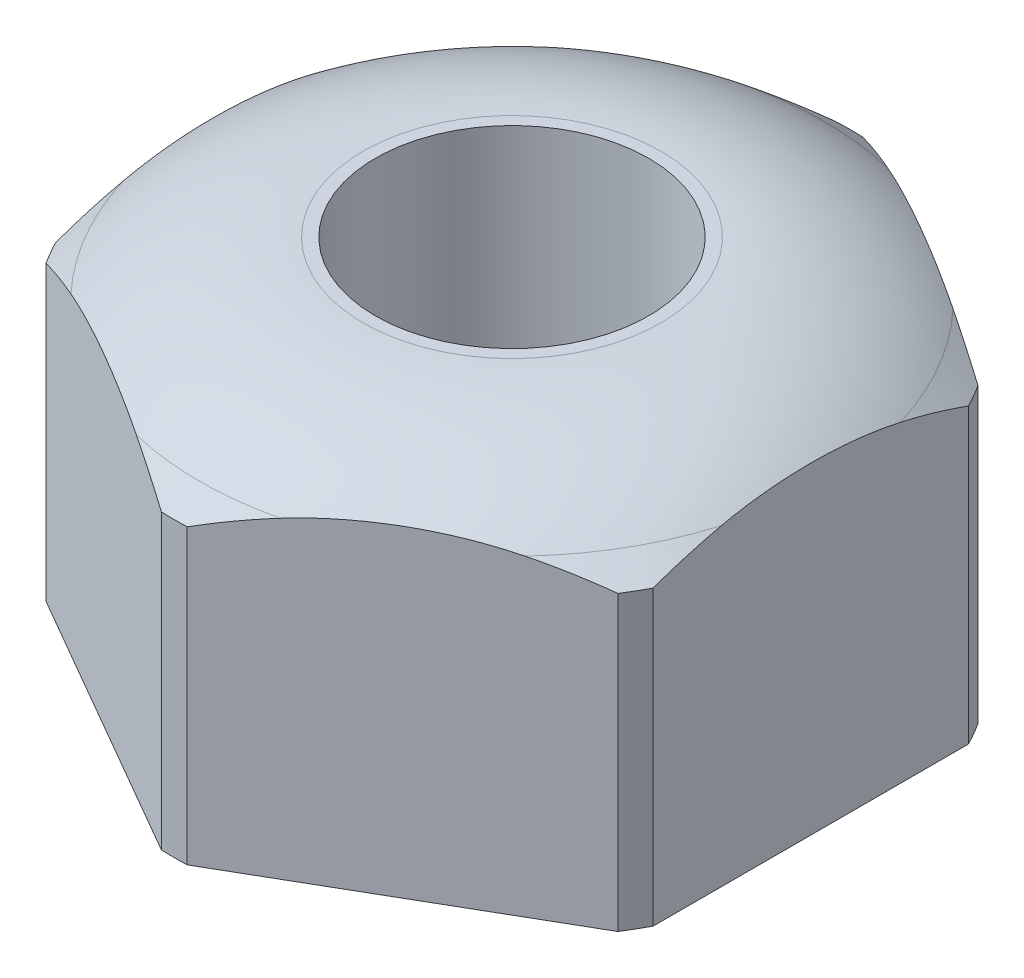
ISO-10303-21;
HEADER;
FILE_DESCRIPTION(('STEP AP214'),'2;1');
FILE_NAME('part.step','',(''),(''),'','','');
FILE_SCHEMA(('AUTOMOTIVE_DESIGN { 1 0 10303 214 1 1 1 1 }'));
ENDSEC;
DATA;
#1=APPLICATION_CONTEXT('core data for automotive mechanical design processes');
#2=APPLICATION_PROTOCOL_DEFINITION('international standard','automotive_design',2000,#1);
#3=PRODUCT_CONTEXT('',#1,'mechanical');
#4=PRODUCT('Part','Part','',(#3));
#5=PRODUCT_RELATED_PRODUCT_CATEGORY('part','',(#4));
#6=PRODUCT_DEFINITION_FORMATION('','',#4);
#7=PRODUCT_DEFINITION_CONTEXT('part definition',#1,'design');
#8=PRODUCT_DEFINITION('design','',#6,#7);
#9=PRODUCT_DEFINITION_SHAPE('','',#8);
#10=(LENGTH_UNIT() NAMED_UNIT(*) SI_UNIT(.MILLI.,.METRE.));
#11=(NAMED_UNIT(*) PLANE_ANGLE_UNIT() SI_UNIT($,.RADIAN.));
#12=(NAMED_UNIT(*) SI_UNIT($,.STERADIAN.) SOLID_ANGLE_UNIT());
#13=UNCERTAINTY_MEASURE_WITH_UNIT(LENGTH_MEASURE(1.E-05),#10,'distance_accuracy_value','');
#14=(GEOMETRIC_REPRESENTATION_CONTEXT(3) GLOBAL_UNCERTAINTY_ASSIGNED_CONTEXT((#13)) GLOBAL_UNIT_ASSIGNED_CONTEXT((#10,
#11,#12)) REPRESENTATION_CONTEXT('',''));
#15=CARTESIAN_POINT('',(0.,0.,0.));
#16=DIRECTION('',(0.,0.,1.));
#17=DIRECTION('',(1.,0.,0.));
#18=AXIS2_PLACEMENT_3D('',#15,#16,#17);
#19=CARTESIAN_POINT('',(0.,3.048,0.));
#20=DIRECTION('',(0.,-1.,0.));
#21=DIRECTION('',(0.,0.,-1.));
#22=AXIS2_PLACEMENT_3D('',#19,#20,#21);
#23=CONICAL_SURFACE('',#22,3.5179,0.916536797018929);
#24=CARTESIAN_POINT('',(3.11149999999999,1.88602973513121,-3.95591197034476));
#25=CARTESIAN_POINT('',(3.11149999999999,1.94413278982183,-3.85950824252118));
#26=CARTESIAN_POINT('',(3.11149999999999,2.00165841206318,-3.76275146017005));
#27=CARTESIAN_POINT('',(3.11149999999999,2.11530430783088,-3.56839627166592));
#28=CARTESIAN_POINT('',(3.11149999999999,2.17142435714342,-3.47079773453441));
#29=CARTESIAN_POINT('',(3.11149999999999,2.28222796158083,-3.27423193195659));
#30=CARTESIAN_POINT('',(3.11149999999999,2.3369042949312,-3.17526058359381));
#31=CARTESIAN_POINT('',(3.11149999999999,2.44422032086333,-2.97622245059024));
#32=CARTESIAN_POINT('',(3.11149999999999,2.49686010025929,-2.87615571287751));
#33=CARTESIAN_POINT('',(3.11149999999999,2.6018195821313,-2.67056560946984));
#34=CARTESIAN_POINT('',(3.11149999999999,2.65403461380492,-2.56498857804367));
#35=CARTESIAN_POINT('',(3.11149999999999,2.75517927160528,-2.35227427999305));
#36=CARTESIAN_POINT('',(3.11149999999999,2.80410914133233,-2.24513712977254));
#37=CARTESIAN_POINT('',(3.11149999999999,2.89785034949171,-2.02925111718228));
#38=CARTESIAN_POINT('',(3.11149999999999,2.9426676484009,-1.92050486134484));
#39=CARTESIAN_POINT('',(3.11149999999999,3.0273068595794,-1.70109864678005));
#40=CARTESIAN_POINT('',(3.11149999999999,3.06712984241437,-1.59043910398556));
#41=CARTESIAN_POINT('',(3.11149999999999,3.14547670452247,-1.35245039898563));
#42=CARTESIAN_POINT('',(3.11149999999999,3.18314766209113,-1.22483584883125));
#43=CARTESIAN_POINT('',(3.11149999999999,3.24881225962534,-0.967103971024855));
#44=CARTESIAN_POINT('',(3.11149999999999,3.27680645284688,-0.836986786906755));
#45=CARTESIAN_POINT('',(3.11149999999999,3.3209563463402,-0.576754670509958));
#46=CARTESIAN_POINT('',(3.11149999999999,3.33728575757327,-0.446669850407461));
#47=CARTESIAN_POINT('',(3.11149999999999,3.35752324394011,-0.185532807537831));
#48=CARTESIAN_POINT('',(3.11149999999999,3.36143318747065,-0.0544807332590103));
#49=CARTESIAN_POINT('',(3.11149999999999,3.35649375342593,0.207780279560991));
#50=CARTESIAN_POINT('',(3.11149999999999,3.34760509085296,0.338988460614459));
#51=CARTESIAN_POINT('',(3.11149999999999,3.31774189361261,0.600013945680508));
#52=CARTESIAN_POINT('',(3.11149999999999,3.2967649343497,0.729830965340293));
#53=CARTESIAN_POINT('',(3.11149999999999,3.24385178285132,0.989241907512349));
#54=CARTESIAN_POINT('',(3.11149999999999,3.21175256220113,1.11880192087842));
#55=CARTESIAN_POINT('',(3.11149999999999,3.13856473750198,1.37531351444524));
#56=CARTESIAN_POINT('',(3.11149999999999,3.09747585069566,1.50226501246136));
#57=CARTESIAN_POINT('',(3.11149999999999,2.97857466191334,1.83674265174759));
#58=CARTESIAN_POINT('',(3.11149999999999,2.8944514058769,2.04200819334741));
#59=CARTESIAN_POINT('',(3.11149999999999,2.7128877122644,2.44669309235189));
#60=CARTESIAN_POINT('',(3.11149999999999,2.61543070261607,2.6461047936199));
#61=CARTESIAN_POINT('',(3.11149999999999,2.46446729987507,2.93787466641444));
#62=CARTESIAN_POINT('',(3.11149999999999,2.41441922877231,3.03204918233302));
#63=CARTESIAN_POINT('',(3.11149999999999,2.31256172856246,3.2194462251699));
#64=CARTESIAN_POINT('',(3.11149999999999,2.26075224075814,3.31266872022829));
#65=CARTESIAN_POINT('',(3.11149999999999,2.1558274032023,3.49798299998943));
#66=CARTESIAN_POINT('',(3.11149999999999,2.10271671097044,3.59007743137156));
#67=CARTESIAN_POINT('',(3.11149999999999,1.99525298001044,3.77352362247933));
#68=CARTESIAN_POINT('',(3.11149999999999,1.94090009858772,3.86487547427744));
#69=CARTESIAN_POINT('',(3.11149999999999,1.88602973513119,3.95591197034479));
#70=B_SPLINE_CURVE_WITH_KNOTS('',3,(#24,#25,#26,#27,#28,#29,#30,#31,#32,#33,#34,#35,#36,#37,#38,
#39,#40,#41,#42,#43,#44,#45,#46,#47,#48,#49,#50,#51,#52,#53,#54,#55,#56,#57,#58,#59,#60,#61,#62,
#63,#64,#65,#66,#67,#68,#69),.UNSPECIFIED.,.F.,.F.,(4,2,2,2,2,2,2,2,2,2,2,2,2,2,2,2,2,2,2,2,2,2,
4),(0.,0.337682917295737,0.675419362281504,1.01460933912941,1.35378484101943,1.70708874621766,
2.0603664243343,2.41312372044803,2.76580527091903,3.16466816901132,3.5635082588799,
3.95627749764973,4.34898764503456,4.74290577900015,5.13690295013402,5.53693830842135,
5.93698625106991,6.60170712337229,7.26726178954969,7.58718923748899,7.90712735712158,
8.22605179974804,8.54493607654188),.UNSPECIFIED.);
#71=CARTESIAN_POINT('',(3.11149999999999,3.048,-1.64139823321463));
#72=VERTEX_POINT('',#71);
#73=CARTESIAN_POINT('',(3.11149999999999,3.25503713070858,-0.931530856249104));
#74=VERTEX_POINT('',#73);
#75=EDGE_CURVE('E193',#72,#74,#70,.T.);
#76=ORIENTED_EDGE('',*,*,#75,.F.);
#77=CARTESIAN_POINT('',(0.,3.048,0.));
#78=DIRECTION('',(0.,-1.,0.));
#79=DIRECTION('',(0.,0.,-1.));
#80=AXIS2_PLACEMENT_3D('',#77,#78,#79);
#81=CIRCLE('',#80,3.5179);
#82=CARTESIAN_POINT('',(2.97724256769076,3.048,-1.87393892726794));
#83=VERTEX_POINT('',#82);
#84=EDGE_CURVE('E204',#83,#72,#81,.T.);
#85=ORIENTED_EDGE('',*,*,#84,.F.);
#86=CARTESIAN_POINT('',(-2.13739389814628,1.69737679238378,-4.82687566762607));
#87=CARTESIAN_POINT('',(-2.05514812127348,1.75620750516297,-4.77939104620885));
#88=CARTESIAN_POINT('',(-1.97264197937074,1.81455828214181,-4.7317561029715));
#89=CARTESIAN_POINT('',(-1.80701402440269,1.9301046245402,-4.63613075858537));
#90=CARTESIAN_POINT('',(-1.72389214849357,1.98730006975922,-4.58814032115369));
#91=CARTESIAN_POINT('',(-1.55672517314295,2.10048360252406,-4.49162642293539));
#92=CARTESIAN_POINT('',(-1.47267816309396,2.15646793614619,-4.44310185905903));
#93=CARTESIAN_POINT('',(-1.30378416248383,2.26680055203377,-4.34559086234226));
#94=CARTESIAN_POINT('',(-1.21893719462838,2.32114888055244,-4.29660444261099));
#95=CARTESIAN_POINT('',(-1.04453508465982,2.43025483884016,-4.1959133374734));
#96=CARTESIAN_POINT('',(-0.954938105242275,2.48492359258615,-4.1441844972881));
#97=CARTESIAN_POINT('',(-0.77458850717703,2.59165497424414,-4.04005960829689));
#98=CARTESIAN_POINT('',(-0.683835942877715,2.64371772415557,-3.98766359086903));
#99=CARTESIAN_POINT('',(-0.501085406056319,2.74460436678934,-3.88215251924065));
#100=CARTESIAN_POINT('',(-0.409088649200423,2.79343117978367,-3.82903816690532));
#101=CARTESIAN_POINT('',(-0.223611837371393,2.88715021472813,-3.7219530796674));
#102=CARTESIAN_POINT('',(-0.130131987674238,2.93204297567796,-3.66798246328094));
#103=CARTESIAN_POINT('',(0.0741153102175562,3.02403266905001,-3.55006023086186));
#104=CARTESIAN_POINT('',(0.185179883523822,3.07026149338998,-3.48593706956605));
#105=CARTESIAN_POINT('',(0.409688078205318,3.15438273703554,-3.35631720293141));
#106=CARTESIAN_POINT('',(0.523131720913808,3.19227508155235,-3.29082048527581));
#107=CARTESIAN_POINT('',(0.75042751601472,3.25718479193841,-3.15959119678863));
#108=CARTESIAN_POINT('',(0.864243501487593,3.28436786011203,-3.09387950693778));
#109=CARTESIAN_POINT('',(1.09353817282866,3.32686817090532,-2.96149616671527));
#110=CARTESIAN_POINT('',(1.2090164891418,3.34218801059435,-2.89482472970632));
#111=CARTESIAN_POINT('',(1.44196980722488,3.35979417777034,-2.76032906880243));
#112=CARTESIAN_POINT('',(1.5594529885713,3.3619403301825,-2.69250012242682));
#113=CARTESIAN_POINT('',(1.7940104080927,3.35262664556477,-2.55707833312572));
#114=CARTESIAN_POINT('',(1.91108461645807,3.34116583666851,-2.4894855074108));
#115=CARTESIAN_POINT('',(2.14574064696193,3.30534181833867,-2.35400678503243));
#116=CARTESIAN_POINT('',(2.26329704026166,3.2807617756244,-2.28613556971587));
#117=CARTESIAN_POINT('',(2.49620766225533,3.22045198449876,-2.1516645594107));
#118=CARTESIAN_POINT('',(2.61156168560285,3.18472120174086,-2.0850648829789));
#119=CARTESIAN_POINT('',(2.84090311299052,3.10383697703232,-1.9526545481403));
#120=CARTESIAN_POINT('',(2.95486769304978,3.05859865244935,-1.886857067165));
#121=CARTESIAN_POINT('',(3.18045343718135,2.9608456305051,-1.75661507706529));
#122=CARTESIAN_POINT('',(3.29207363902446,2.90832801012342,-1.69217112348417));
#123=CARTESIAN_POINT('',(3.51346018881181,2.79748703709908,-1.56435353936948));
#124=CARTESIAN_POINT('',(3.62322087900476,2.73914875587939,-1.50098317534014));
#125=CARTESIAN_POINT('',(3.8408630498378,2.61804547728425,-1.37532740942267));
#126=CARTESIAN_POINT('',(3.94874479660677,2.55528111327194,-1.31304185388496));
#127=CARTESIAN_POINT('',(4.15793394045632,2.4292782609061,-1.19226644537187));
#128=CARTESIAN_POINT('',(4.25931334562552,2.36619831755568,-1.13373501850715));
#129=CARTESIAN_POINT('',(4.4608584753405,2.23749572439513,-1.01737288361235));
#130=CARTESIAN_POINT('',(4.56102412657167,2.17187292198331,-0.959542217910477));
#131=CARTESIAN_POINT('',(4.75964001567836,2.03903291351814,-0.844871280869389));
#132=CARTESIAN_POINT('',(4.85809730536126,1.97182971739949,-0.788026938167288));
#133=CARTESIAN_POINT('',(5.05412126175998,1.83576367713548,-0.674852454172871));
#134=CARTESIAN_POINT('',(5.15168810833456,1.76690117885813,-0.618522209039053));
#135=CARTESIAN_POINT('',(5.24889389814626,1.6973767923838,-0.562400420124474));
#136=B_SPLINE_CURVE_WITH_KNOTS('',3,(#86,#87,#88,#89,#90,#91,#92,#93,#94,#95,#96,#97,#98,#99,
#100,#101,#102,#103,#104,#105,#106,#107,#108,#109,#110,#111,#112,#113,#114,#115,#116,#117,#118,
#119,#120,#121,#122,#123,#124,#125,#126,#127,#128,#129,#130,#131,#132,#133,#134,#135),
.UNSPECIFIED.,.F.,.F.,(4,2,2,2,2,2,2,2,2,2,2,2,2,2,2,2,2,2,2,2,2,2,2,2,4),(0.,0.335147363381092,
0.670329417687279,1.00643347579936,1.34252802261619,1.69353823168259,2.0445319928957,
2.39520456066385,2.74582900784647,3.15457244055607,3.5633195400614,3.96546729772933,
4.36752699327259,4.77385750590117,5.18021704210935,5.59351082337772,6.00684295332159,
6.4240352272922,6.84139551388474,7.25985517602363,7.67825507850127,8.07714734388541,
8.47606358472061,8.87224579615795,9.26834612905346),.UNSPECIFIED.);
#137=CARTESIAN_POINT('',(2.3624793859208,3.25503713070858,-2.22887261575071));
#138=VERTEX_POINT('',#137);
#139=EDGE_CURVE('E272',#138,#83,#136,.T.);
#140=ORIENTED_EDGE('',*,*,#139,.F.);
#141=CARTESIAN_POINT('',(0.,3.25503713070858,0.));
#142=DIRECTION('',(0.,-1.,0.));
#143=DIRECTION('',(0.,0.,-1.));
#144=AXIS2_PLACEMENT_3D('',#141,#142,#143);
#145=CIRCLE('',#144,3.24795042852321);
#146=EDGE_CURVE('E209',#138,#74,#145,.T.);
#147=ORIENTED_EDGE('',*,*,#146,.T.);
#148=EDGE_LOOP('',(#76,#85,#140,#147));
#149=FACE_BOUND('',#148,.T.);
#150=ADVANCED_FACE('F32',(#149),#23,.T.);
#151=CARTESIAN_POINT('',(0.134257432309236,3.04800000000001,-3.51533716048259));
#152=VERTEX_POINT('',#151);
#153=CARTESIAN_POINT('',(0.749020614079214,3.25503713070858,-3.16040347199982));
#154=VERTEX_POINT('',#153);
#155=EDGE_CURVE('E277',#152,#154,#136,.T.);
#156=ORIENTED_EDGE('',*,*,#155,.F.);
#157=CARTESIAN_POINT('',(-0.134257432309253,3.048,-3.51533716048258));
#158=VERTEX_POINT('',#157);
#159=EDGE_CURVE('E200',#158,#152,#81,.T.);
#160=ORIENTED_EDGE('',*,*,#159,.F.);
#161=CARTESIAN_POINT('',(-5.24889389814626,1.6973767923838,-0.562400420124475));
#162=CARTESIAN_POINT('',(-5.16664812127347,1.75620750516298,-0.609885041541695));
#163=CARTESIAN_POINT('',(-5.08414197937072,1.81455828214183,-0.657519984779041));
#164=CARTESIAN_POINT('',(-4.91851402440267,1.93010462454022,-0.753145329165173));
#165=CARTESIAN_POINT('',(-4.83539214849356,1.98730006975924,-0.801135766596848));
#166=CARTESIAN_POINT('',(-4.66822517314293,2.10048360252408,-0.897649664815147));
#167=CARTESIAN_POINT('',(-4.58417816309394,2.15646793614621,-0.946174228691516));
#168=CARTESIAN_POINT('',(-4.41528416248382,2.26680055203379,-1.04368522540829));
#169=CARTESIAN_POINT('',(-4.33043719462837,2.32114888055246,-1.09267164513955));
#170=CARTESIAN_POINT('',(-4.1560350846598,2.43025483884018,-1.19336275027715));
#171=CARTESIAN_POINT('',(-4.06643810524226,2.48492359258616,-1.24509159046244));
#172=CARTESIAN_POINT('',(-3.88608850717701,2.59165497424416,-1.34921647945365));
#173=CARTESIAN_POINT('',(-3.7953359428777,2.64371772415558,-1.40161249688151));
#174=CARTESIAN_POINT('',(-3.6125854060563,2.74460436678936,-1.5071235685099));
#175=CARTESIAN_POINT('',(-3.5205886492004,2.79343117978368,-1.56023792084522));
#176=CARTESIAN_POINT('',(-3.33511183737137,2.88715021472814,-1.66732300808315));
#177=CARTESIAN_POINT('',(-3.24163198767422,2.93204297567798,-1.7212936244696));
#178=CARTESIAN_POINT('',(-3.03738468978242,3.02403266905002,-1.83921585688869));
#179=CARTESIAN_POINT('',(-2.92632011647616,3.07026149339,-1.90333901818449));
#180=CARTESIAN_POINT('',(-2.70181192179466,3.15438273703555,-2.03295888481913));
#181=CARTESIAN_POINT('',(-2.58836827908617,3.19227508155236,-2.09845560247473));
#182=CARTESIAN_POINT('',(-2.36107248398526,3.25718479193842,-2.22968489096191));
#183=CARTESIAN_POINT('',(-2.24725649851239,3.28436786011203,-2.29539658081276));
#184=CARTESIAN_POINT('',(-2.01796182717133,3.32686817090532,-2.42777992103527));
#185=CARTESIAN_POINT('',(-1.90248351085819,3.34218801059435,-2.49445135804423));
#186=CARTESIAN_POINT('',(-1.66953019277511,3.35979417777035,-2.62894701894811));
#187=CARTESIAN_POINT('',(-1.55204701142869,3.3619403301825,-2.69677596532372));
#188=CARTESIAN_POINT('',(-1.31748959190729,3.35262664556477,-2.83219775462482));
#189=CARTESIAN_POINT('',(-1.20041538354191,3.34116583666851,-2.89979058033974));
#190=CARTESIAN_POINT('',(-0.965759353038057,3.30534181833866,-3.03526930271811));
#191=CARTESIAN_POINT('',(-0.848202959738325,3.2807617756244,-3.10314051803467));
#192=CARTESIAN_POINT('',(-0.61529233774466,3.22045198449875,-3.23761152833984));
#193=CARTESIAN_POINT('',(-0.499938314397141,3.18472120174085,-3.30421120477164));
#194=CARTESIAN_POINT('',(-0.270596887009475,3.10383697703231,-3.43662153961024));
#195=CARTESIAN_POINT('',(-0.156632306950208,3.05859865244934,-3.50241902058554));
#196=CARTESIAN_POINT('',(0.0689534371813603,2.96084563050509,-3.63266101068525));
#197=CARTESIAN_POINT('',(0.180573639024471,2.90832801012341,-3.69710496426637));
#198=CARTESIAN_POINT('',(0.401960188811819,2.79748703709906,-3.82492254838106));
#199=CARTESIAN_POINT('',(0.511720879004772,2.73914875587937,-3.8882929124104));
#200=CARTESIAN_POINT('',(0.729363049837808,2.61804547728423,-4.01394867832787));
#201=CARTESIAN_POINT('',(0.837244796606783,2.55528111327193,-4.07623423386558));
#202=CARTESIAN_POINT('',(1.04643394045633,2.42927826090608,-4.19700964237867));
#203=CARTESIAN_POINT('',(1.14781334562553,2.36619831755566,-4.25554106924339));
#204=CARTESIAN_POINT('',(1.34935847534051,2.23749572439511,-4.37190320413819));
#205=CARTESIAN_POINT('',(1.44952412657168,2.17187292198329,-4.42973386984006));
#206=CARTESIAN_POINT('',(1.64814001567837,2.03903291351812,-4.54440480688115));
#207=CARTESIAN_POINT('',(1.74659730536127,1.97182971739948,-4.60124914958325));
#208=CARTESIAN_POINT('',(1.94262126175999,1.83576367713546,-4.71442363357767));
#209=CARTESIAN_POINT('',(2.04018810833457,1.76690117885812,-4.77075387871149));
#210=CARTESIAN_POINT('',(2.13739389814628,1.69737679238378,-4.82687566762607));
#211=B_SPLINE_CURVE_WITH_KNOTS('',3,(#161,#162,#163,#164,#165,#166,#167,#168,#169,#170,#171,
#172,#173,#174,#175,#176,#177,#178,#179,#180,#181,#182,#183,#184,#185,#186,#187,#188,#189,#190,
#191,#192,#193,#194,#195,#196,#197,#198,#199,#200,#201,#202,#203,#204,#205,#206,#207,#208,#209,
#210),.UNSPECIFIED.,.F.,.F.,(4,2,2,2,2,2,2,2,2,2,2,2,2,2,2,2,2,2,2,2,2,2,2,2,4),(0.,
0.335147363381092,0.67032941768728,1.00643347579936,1.34252802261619,1.69353823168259,
2.0445319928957,2.39520456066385,2.74582900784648,3.15457244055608,3.5633195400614,
3.96546729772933,4.36752699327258,4.77385750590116,5.18021704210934,5.59351082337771,
6.00684295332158,6.4240352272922,6.84139551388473,7.25985517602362,7.67825507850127,
8.0771473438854,8.47606358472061,8.87224579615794,9.26834612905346),.UNSPECIFIED.);
#212=CARTESIAN_POINT('',(-0.749020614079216,3.25503713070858,-3.16040347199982));
#213=VERTEX_POINT('',#212);
#214=EDGE_CURVE('E47',#213,#158,#211,.T.);
#215=ORIENTED_EDGE('',*,*,#214,.F.);
#216=EDGE_CURVE('E205',#213,#154,#145,.T.);
#217=ORIENTED_EDGE('',*,*,#216,.T.);
#218=EDGE_LOOP('',(#156,#160,#215,#217));
#219=FACE_BOUND('',#218,.T.);
#220=ADVANCED_FACE('F384',(#219),#23,.T.);
#221=CARTESIAN_POINT('',(-2.97724256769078,3.04800000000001,-1.87393892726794));
#222=VERTEX_POINT('',#221);
#223=CARTESIAN_POINT('',(-2.3624793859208,3.25503713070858,-2.22887261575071));
#224=VERTEX_POINT('',#223);
#225=EDGE_CURVE('E270',#222,#224,#211,.T.);
#226=ORIENTED_EDGE('',*,*,#225,.F.);
#227=CARTESIAN_POINT('',(-3.11149999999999,3.048,-1.64139823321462));
#228=VERTEX_POINT('',#227);
#229=EDGE_CURVE('E203',#228,#222,#81,.T.);
#230=ORIENTED_EDGE('',*,*,#229,.F.);
#231=CARTESIAN_POINT('',(-3.11149999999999,1.88602973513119,3.95591197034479));
#232=CARTESIAN_POINT('',(-3.11149999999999,1.94413278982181,3.85950824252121));
#233=CARTESIAN_POINT('',(-3.11149999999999,2.00165841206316,3.76275146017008));
#234=CARTESIAN_POINT('',(-3.11149999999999,2.11530430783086,3.56839627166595));
#235=CARTESIAN_POINT('',(-3.11149999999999,2.1714243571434,3.47079773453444));
#236=CARTESIAN_POINT('',(-3.11149999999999,2.28222796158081,3.27423193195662));
#237=CARTESIAN_POINT('',(-3.11149999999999,2.33690429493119,3.17526058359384));
#238=CARTESIAN_POINT('',(-3.11149999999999,2.44422032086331,2.97622245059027));
#239=CARTESIAN_POINT('',(-3.11149999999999,2.49686010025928,2.87615571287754));
#240=CARTESIAN_POINT('',(-3.11149999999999,2.60181958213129,2.67056560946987));
#241=CARTESIAN_POINT('',(-3.11149999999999,2.65403461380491,2.5649885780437));
#242=CARTESIAN_POINT('',(-3.11149999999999,2.75517927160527,2.35227427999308));
#243=CARTESIAN_POINT('',(-3.11149999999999,2.80410914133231,2.24513712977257));
#244=CARTESIAN_POINT('',(-3.11149999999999,2.8978503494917,2.02925111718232));
#245=CARTESIAN_POINT('',(-3.11149999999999,2.94266764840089,1.92050486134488));
#246=CARTESIAN_POINT('',(-3.11149999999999,3.02730685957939,1.70109864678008));
#247=CARTESIAN_POINT('',(-3.11149999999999,3.06712984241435,1.59043910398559));
#248=CARTESIAN_POINT('',(-3.11149999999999,3.14547670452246,1.35245039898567));
#249=CARTESIAN_POINT('',(-3.11149999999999,3.18314766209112,1.22483584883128));
#250=CARTESIAN_POINT('',(-3.11149999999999,3.24881225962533,0.967103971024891));
#251=CARTESIAN_POINT('',(-3.11149999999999,3.27680645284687,0.836986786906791));
#252=CARTESIAN_POINT('',(-3.11149999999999,3.3209563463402,0.576754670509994));
#253=CARTESIAN_POINT('',(-3.11149999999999,3.33728575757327,0.446669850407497));
#254=CARTESIAN_POINT('',(-3.11149999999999,3.3575232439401,0.185532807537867));
#255=CARTESIAN_POINT('',(-3.11149999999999,3.36143318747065,0.054480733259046));
#256=CARTESIAN_POINT('',(-3.11149999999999,3.35649375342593,-0.207780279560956));
#257=CARTESIAN_POINT('',(-3.11149999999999,3.34760509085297,-0.338988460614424));
#258=CARTESIAN_POINT('',(-3.11149999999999,3.31774189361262,-0.600013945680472));
#259=CARTESIAN_POINT('',(-3.11149999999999,3.2967649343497,-0.729830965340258));
#260=CARTESIAN_POINT('',(-3.11149999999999,3.24385178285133,-0.989241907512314));
#261=CARTESIAN_POINT('',(-3.11149999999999,3.21175256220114,-1.11880192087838));
#262=CARTESIAN_POINT('',(-3.11149999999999,3.13856473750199,-1.3753135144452));
#263=CARTESIAN_POINT('',(-3.11149999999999,3.09747585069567,-1.50226501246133));
#264=CARTESIAN_POINT('',(-3.11149999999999,2.97857466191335,-1.83674265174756));
#265=CARTESIAN_POINT('',(-3.11149999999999,2.89445140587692,-2.04200819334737));
#266=CARTESIAN_POINT('',(-3.11149999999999,2.71288771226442,-2.44669309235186));
#267=CARTESIAN_POINT('',(-3.11149999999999,2.61543070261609,-2.64610479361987));
#268=CARTESIAN_POINT('',(-3.11149999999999,2.46446729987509,-2.93787466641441));
#269=CARTESIAN_POINT('',(-3.11149999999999,2.41441922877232,-3.03204918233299));
#270=CARTESIAN_POINT('',(-3.11149999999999,2.31256172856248,-3.21944622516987));
#271=CARTESIAN_POINT('',(-3.11149999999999,2.26075224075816,-3.31266872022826));
#272=CARTESIAN_POINT('',(-3.11149999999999,2.15582740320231,-3.4979829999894));
#273=CARTESIAN_POINT('',(-3.11149999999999,2.10271671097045,-3.59007743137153));
#274=CARTESIAN_POINT('',(-3.11149999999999,1.99525298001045,-3.7735236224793));
#275=CARTESIAN_POINT('',(-3.11149999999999,1.94090009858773,-3.86487547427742));
#276=CARTESIAN_POINT('',(-3.11149999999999,1.88602973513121,-3.95591197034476));
#277=B_SPLINE_CURVE_WITH_KNOTS('',3,(#231,#232,#233,#234,#235,#236,#237,#238,#239,#240,#241,
#242,#243,#244,#245,#246,#247,#248,#249,#250,#251,#252,#253,#254,#255,#256,#257,#258,#259,#260,
#261,#262,#263,#264,#265,#266,#267,#268,#269,#270,#271,#272,#273,#274,#275,#276),.UNSPECIFIED.,
.F.,.F.,(4,2,2,2,2,2,2,2,2,2,2,2,2,2,2,2,2,2,2,2,2,2,4),(0.,0.337682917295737,0.675419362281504,
1.01460933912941,1.35378484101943,1.70708874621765,2.0603664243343,2.41312372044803,
2.76580527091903,3.16466816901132,3.5635082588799,3.95627749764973,4.34898764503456,
4.74290577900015,5.13690295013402,5.53693830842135,5.93698625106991,6.60170712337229,
7.26726178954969,7.58718923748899,7.90712735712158,8.22605179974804,8.54493607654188),.UNSPECIFIED.);
#278=CARTESIAN_POINT('',(-3.11149999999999,3.25503713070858,-0.931530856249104));
#279=VERTEX_POINT('',#278);
#280=EDGE_CURVE('E55',#279,#228,#277,.T.);
#281=ORIENTED_EDGE('',*,*,#280,.F.);
#282=EDGE_CURVE('E208',#279,#224,#145,.T.);
#283=ORIENTED_EDGE('',*,*,#282,.T.);
#284=EDGE_LOOP('',(#226,#230,#281,#283));
#285=FACE_BOUND('',#284,.T.);
#286=ADVANCED_FACE('F267',(#285),#23,.T.);
#287=CARTESIAN_POINT('',(-3.11149999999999,3.048,1.64139823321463));
#288=VERTEX_POINT('',#287);
#289=CARTESIAN_POINT('',(-3.11149999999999,3.25503713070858,0.931530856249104));
#290=VERTEX_POINT('',#289);
#291=EDGE_CURVE('E285',#288,#290,#277,.T.);
#292=ORIENTED_EDGE('',*,*,#291,.F.);
#293=CARTESIAN_POINT('',(-2.97724256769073,3.048,1.87393892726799));
#294=VERTEX_POINT('',#293);
#295=EDGE_CURVE('E255',#294,#288,#81,.T.);
#296=ORIENTED_EDGE('',*,*,#295,.F.);
#297=CARTESIAN_POINT('',(2.13739389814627,1.69737679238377,4.82687566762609));
#298=CARTESIAN_POINT('',(2.05514812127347,1.75620750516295,4.77939104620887));
#299=CARTESIAN_POINT('',(1.97264197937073,1.8145582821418,4.73175610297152));
#300=CARTESIAN_POINT('',(1.80701402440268,1.93010462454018,4.63613075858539));
#301=CARTESIAN_POINT('',(1.72389214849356,1.98730006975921,4.58814032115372));
#302=CARTESIAN_POINT('',(1.55672517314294,2.10048360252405,4.49162642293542));
#303=CARTESIAN_POINT('',(1.47267816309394,2.15646793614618,4.44310185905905));
#304=CARTESIAN_POINT('',(1.30378416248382,2.26680055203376,4.34559086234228));
#305=CARTESIAN_POINT('',(1.21893719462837,2.32114888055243,4.29660444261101));
#306=CARTESIAN_POINT('',(1.0445350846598,2.43025483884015,4.19591333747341));
#307=CARTESIAN_POINT('',(0.954938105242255,2.48492359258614,4.14418449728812));
#308=CARTESIAN_POINT('',(0.774588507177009,2.59165497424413,4.04005960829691));
#309=CARTESIAN_POINT('',(0.683835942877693,2.64371772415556,3.98766359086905));
#310=CARTESIAN_POINT('',(0.501085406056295,2.74460436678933,3.88215251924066));
#311=CARTESIAN_POINT('',(0.409088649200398,2.79343117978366,3.82903816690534));
#312=CARTESIAN_POINT('',(0.223611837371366,2.88715021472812,3.72195307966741));
#313=CARTESIAN_POINT('',(0.13013198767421,2.93204297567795,3.66798246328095));
#314=CARTESIAN_POINT('',(-0.0741153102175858,3.02403266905,3.55006023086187));
#315=CARTESIAN_POINT('',(-0.185179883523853,3.07026149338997,3.48593706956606));
#316=CARTESIAN_POINT('',(-0.40968807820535,3.15438273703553,3.35631720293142));
#317=CARTESIAN_POINT('',(-0.523131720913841,3.19227508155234,3.29082048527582));
#318=CARTESIAN_POINT('',(-0.750427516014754,3.25718479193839,3.15959119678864));
#319=CARTESIAN_POINT('',(-0.864243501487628,3.28436786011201,3.09387950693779));
#320=CARTESIAN_POINT('',(-1.09353817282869,3.32686817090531,2.96149616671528));
#321=CARTESIAN_POINT('',(-1.20901648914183,3.34218801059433,2.89482472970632));
#322=CARTESIAN_POINT('',(-1.44196980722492,3.35979417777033,2.76032906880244));
#323=CARTESIAN_POINT('',(-1.55945298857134,3.36194033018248,2.69250012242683));
#324=CARTESIAN_POINT('',(-1.79401040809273,3.35262664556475,2.55707833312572));
#325=CARTESIAN_POINT('',(-1.91108461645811,3.34116583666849,2.48948550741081));
#326=CARTESIAN_POINT('',(-2.14574064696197,3.30534181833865,2.35400678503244));
#327=CARTESIAN_POINT('',(-2.2632970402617,3.28076177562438,2.28613556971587));
#328=CARTESIAN_POINT('',(-2.49620766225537,3.22045198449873,2.1516645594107));
#329=CARTESIAN_POINT('',(-2.61156168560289,3.18472120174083,2.08506488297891));
#330=CARTESIAN_POINT('',(-2.84090311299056,3.10383697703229,1.9526545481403));
#331=CARTESIAN_POINT('',(-2.95486769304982,3.05859865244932,1.886857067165));
#332=CARTESIAN_POINT('',(-3.18045343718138,2.96084563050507,1.7566150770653));
#333=CARTESIAN_POINT('',(-3.29207363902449,2.90832801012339,1.69217112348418));
#334=CARTESIAN_POINT('',(-3.51346018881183,2.79748703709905,1.5643535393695));
#335=CARTESIAN_POINT('',(-3.62322087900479,2.73914875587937,1.50098317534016));
#336=CARTESIAN_POINT('',(-3.84086304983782,2.61804547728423,1.37532740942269));
#337=CARTESIAN_POINT('',(-3.94874479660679,2.55528111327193,1.31304185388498));
#338=CARTESIAN_POINT('',(-4.15793394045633,2.42927826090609,1.19226644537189));
#339=CARTESIAN_POINT('',(-4.25931334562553,2.36619831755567,1.13373501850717));
#340=CARTESIAN_POINT('',(-4.4608584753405,2.23749572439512,1.01737288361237));
#341=CARTESIAN_POINT('',(-4.56102412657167,2.1718729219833,0.959542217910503));
#342=CARTESIAN_POINT('',(-4.75964001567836,2.03903291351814,0.844871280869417));
#343=CARTESIAN_POINT('',(-4.85809730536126,1.97182971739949,0.788026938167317));
#344=CARTESIAN_POINT('',(-5.05412126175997,1.83576367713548,0.674852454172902));
#345=CARTESIAN_POINT('',(-5.15168810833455,1.76690117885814,0.618522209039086));
#346=CARTESIAN_POINT('',(-5.24889389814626,1.69737679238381,0.562400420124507));
#347=B_SPLINE_CURVE_WITH_KNOTS('',3,(#297,#298,#299,#300,#301,#302,#303,#304,#305,#306,#307,
#308,#309,#310,#311,#312,#313,#314,#315,#316,#317,#318,#319,#320,#321,#322,#323,#324,#325,#326,
#327,#328,#329,#330,#331,#332,#333,#334,#335,#336,#337,#338,#339,#340,#341,#342,#343,#344,#345,
#346),.UNSPECIFIED.,.F.,.F.,(4,2,2,2,2,2,2,2,2,2,2,2,2,2,2,2,2,2,2,2,2,2,2,2,4),(0.,
0.335147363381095,0.670329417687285,1.00643347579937,1.3425280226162,1.69353823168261,
2.04453199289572,2.39520456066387,2.7458290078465,3.1545724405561,3.56331954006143,
3.96546729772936,4.36752699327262,4.7738575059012,5.18021704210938,5.59351082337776,
6.00684295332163,6.42403522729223,6.84139551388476,7.25985517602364,7.67825507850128,
8.0771473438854,8.4760635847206,8.87224579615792,9.26834612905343),.UNSPECIFIED.);
#348=CARTESIAN_POINT('',(-2.36247938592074,3.25503713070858,2.22887261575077));
#349=VERTEX_POINT('',#348);
#350=EDGE_CURVE('E298',#349,#294,#347,.T.);
#351=ORIENTED_EDGE('',*,*,#350,.F.);
#352=EDGE_CURVE('E414',#349,#290,#145,.T.);
#353=ORIENTED_EDGE('',*,*,#352,.T.);
#354=EDGE_LOOP('',(#292,#296,#351,#353));
#355=FACE_BOUND('',#354,.T.);
#356=ADVANCED_FACE('F412',(#355),#23,.T.);
#357=CARTESIAN_POINT('',(-0.134257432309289,3.04800000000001,3.51533716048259));
#358=VERTEX_POINT('',#357);
#359=CARTESIAN_POINT('',(-0.749020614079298,3.25503713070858,3.1604034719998));
#360=VERTEX_POINT('',#359);
#361=EDGE_CURVE('E295',#358,#360,#347,.T.);
#362=ORIENTED_EDGE('',*,*,#361,.F.);
#363=CARTESIAN_POINT('',(0.134257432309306,3.048,3.51533716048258));
#364=VERTEX_POINT('',#363);
#365=EDGE_CURVE('E253',#364,#358,#81,.T.);
#366=ORIENTED_EDGE('',*,*,#365,.F.);
#367=CARTESIAN_POINT('',(5.24889389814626,1.6973767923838,0.562400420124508));
#368=CARTESIAN_POINT('',(5.16664812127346,1.75620750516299,0.609885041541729));
#369=CARTESIAN_POINT('',(5.08414197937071,1.81455828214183,0.657519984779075));
#370=CARTESIAN_POINT('',(4.91851402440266,1.93010462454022,0.753145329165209));
#371=CARTESIAN_POINT('',(4.83539214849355,1.98730006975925,0.801135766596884));
#372=CARTESIAN_POINT('',(4.66822517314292,2.10048360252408,0.897649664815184));
#373=CARTESIAN_POINT('',(4.58417816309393,2.15646793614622,0.946174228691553));
#374=CARTESIAN_POINT('',(4.4152841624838,2.26680055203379,1.04368522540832));
#375=CARTESIAN_POINT('',(4.33043719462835,2.32114888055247,1.09267164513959));
#376=CARTESIAN_POINT('',(4.15603508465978,2.43025483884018,1.19336275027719));
#377=CARTESIAN_POINT('',(4.06643810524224,2.48492359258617,1.24509159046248));
#378=CARTESIAN_POINT('',(3.88608850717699,2.59165497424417,1.34921647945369));
#379=CARTESIAN_POINT('',(3.79533594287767,2.64371772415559,1.40161249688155));
#380=CARTESIAN_POINT('',(3.61258540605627,2.74460436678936,1.50712356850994));
#381=CARTESIAN_POINT('',(3.52058864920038,2.79343117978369,1.56023792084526));
#382=CARTESIAN_POINT('',(3.33511183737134,2.88715021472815,1.66732300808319));
#383=CARTESIAN_POINT('',(3.24163198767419,2.93204297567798,1.72129362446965));
#384=CARTESIAN_POINT('',(3.03738468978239,3.02403266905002,1.83921585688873));
#385=CARTESIAN_POINT('',(2.92632011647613,3.07026149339,1.90333901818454));
#386=CARTESIAN_POINT('',(2.70181192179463,3.15438273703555,2.03295888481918));
#387=CARTESIAN_POINT('',(2.58836827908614,3.19227508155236,2.09845560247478));
#388=CARTESIAN_POINT('',(2.36107248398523,3.25718479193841,2.22968489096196));
#389=CARTESIAN_POINT('',(2.24725649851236,3.28436786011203,2.29539658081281));
#390=CARTESIAN_POINT('',(2.01796182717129,3.32686817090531,2.42777992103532));
#391=CARTESIAN_POINT('',(1.90248351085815,3.34218801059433,2.49445135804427));
#392=CARTESIAN_POINT('',(1.66953019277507,3.35979417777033,2.62894701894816));
#393=CARTESIAN_POINT('',(1.55204701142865,3.36194033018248,2.69677596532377));
#394=CARTESIAN_POINT('',(1.31748959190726,3.35262664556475,2.83219775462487));
#395=CARTESIAN_POINT('',(1.20041538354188,3.34116583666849,2.89979058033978));
#396=CARTESIAN_POINT('',(0.965759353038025,3.30534181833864,3.03526930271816));
#397=CARTESIAN_POINT('',(0.848202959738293,3.28076177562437,3.10314051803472));
#398=CARTESIAN_POINT('',(0.615292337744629,3.22045198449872,3.23761152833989));
#399=CARTESIAN_POINT('',(0.49993831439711,3.18472120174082,3.30421120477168));
#400=CARTESIAN_POINT('',(0.270596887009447,3.10383697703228,3.43662153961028));
#401=CARTESIAN_POINT('',(0.156632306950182,3.0585986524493,3.50241902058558));
#402=CARTESIAN_POINT('',(-0.0689534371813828,2.96084563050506,3.63266101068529));
#403=CARTESIAN_POINT('',(-0.180573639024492,2.90832801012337,3.69710496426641));
#404=CARTESIAN_POINT('',(-0.401960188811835,2.79748703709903,3.82492254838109));
#405=CARTESIAN_POINT('',(-0.511720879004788,2.73914875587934,3.88829291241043));
#406=CARTESIAN_POINT('',(-0.72936304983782,2.61804547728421,4.0139486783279));
#407=CARTESIAN_POINT('',(-0.837244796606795,2.5552811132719,4.07623423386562));
#408=CARTESIAN_POINT('',(-1.04643394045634,2.42927826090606,4.1970096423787));
#409=CARTESIAN_POINT('',(-1.14781334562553,2.36619831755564,4.25554106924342));
#410=CARTESIAN_POINT('',(-1.34935847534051,2.23749572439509,4.37190320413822));
#411=CARTESIAN_POINT('',(-1.44952412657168,2.17187292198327,4.42973386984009));
#412=CARTESIAN_POINT('',(-1.64814001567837,2.0390329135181,4.54440480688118));
#413=CARTESIAN_POINT('',(-1.74659730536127,1.97182971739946,4.60124914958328));
#414=CARTESIAN_POINT('',(-1.94262126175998,1.83576367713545,4.71442363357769));
#415=CARTESIAN_POINT('',(-2.04018810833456,1.7669011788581,4.77075387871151));
#416=CARTESIAN_POINT('',(-2.13739389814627,1.69737679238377,4.82687566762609));
#417=B_SPLINE_CURVE_WITH_KNOTS('',3,(#367,#368,#369,#370,#371,#372,#373,#374,#375,#376,#377,
#378,#379,#380,#381,#382,#383,#384,#385,#386,#387,#388,#389,#390,#391,#392,#393,#394,#395,#396,
#397,#398,#399,#400,#401,#402,#403,#404,#405,#406,#407,#408,#409,#410,#411,#412,#413,#414,#415,
#416),.UNSPECIFIED.,.F.,.F.,(4,2,2,2,2,2,2,2,2,2,2,2,2,2,2,2,2,2,2,2,2,2,2,2,4),(0.,
0.335147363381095,0.670329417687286,1.00643347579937,1.34252802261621,1.69353823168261,
2.04453199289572,2.39520456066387,2.7458290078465,3.1545724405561,3.56331954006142,
3.96546729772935,4.3675269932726,4.77385750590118,5.18021704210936,5.59351082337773,
6.0068429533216,6.42403522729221,6.84139551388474,7.25985517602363,7.67825507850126,
8.07714734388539,8.47606358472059,8.87224579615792,9.26834612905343),.UNSPECIFIED.);
#418=CARTESIAN_POINT('',(0.7490206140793,3.25503713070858,3.1604034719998));
#419=VERTEX_POINT('',#418);
#420=EDGE_CURVE('E162',#419,#364,#417,.T.);
#421=ORIENTED_EDGE('',*,*,#420,.F.);
#422=EDGE_CURVE('E415',#419,#360,#145,.T.);
#423=ORIENTED_EDGE('',*,*,#422,.T.);
#424=EDGE_LOOP('',(#362,#366,#421,#423));
#425=FACE_BOUND('',#424,.T.);
#426=ADVANCED_FACE('F377',(#425),#23,.T.);
#427=CARTESIAN_POINT('',(0.,-25.4,0.));
#428=DIRECTION('',(0.,-1.,0.));
#429=DIRECTION('',(0.,0.,-1.));
#430=AXIS2_PLACEMENT_3D('',#427,#428,#429);
#431=CYLINDRICAL_SURFACE('',#430,3.5179);
#432=ORIENTED_EDGE('',*,*,#84,.T.);
#433=DIRECTION('',(0.,-1.,0.));
#434=VECTOR('',#433,1.);
#435=CARTESIAN_POINT('',(3.11149999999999,-25.4,-1.64139823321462));
#436=LINE('',#435,#434);
#437=CARTESIAN_POINT('',(3.11149999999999,0.,-1.64139823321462));
#438=VERTEX_POINT('',#437);
#439=EDGE_CURVE('E11',#72,#438,#436,.T.);
#440=ORIENTED_EDGE('',*,*,#439,.T.);
#441=CARTESIAN_POINT('',(0.,0.,0.));
#442=DIRECTION('',(0.,-1.,0.));
#443=DIRECTION('',(0.,0.,-1.));
#444=AXIS2_PLACEMENT_3D('',#441,#442,#443);
#445=CIRCLE('',#444,3.5179);
#446=CARTESIAN_POINT('',(2.97724256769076,0.,-1.87393892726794));
#447=VERTEX_POINT('',#446);
#448=EDGE_CURVE('E186',#447,#438,#445,.T.);
#449=ORIENTED_EDGE('',*,*,#448,.F.);
#450=DIRECTION('',(0.,-1.,0.));
#451=VECTOR('',#450,1.);
#452=CARTESIAN_POINT('',(2.97724256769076,-25.4,-1.87393892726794));
#453=LINE('',#452,#451);
#454=EDGE_CURVE('E233',#447,#83,#453,.F.);
#455=ORIENTED_EDGE('',*,*,#454,.T.);
#456=EDGE_LOOP('',(#432,#440,#449,#455));
#457=FACE_BOUND('',#456,.T.);
#458=ADVANCED_FACE('F373',(#457),#431,.T.);
#459=ORIENTED_EDGE('',*,*,#159,.T.);
#460=DIRECTION('',(0.,-1.,0.));
#461=VECTOR('',#460,1.);
#462=CARTESIAN_POINT('',(0.134257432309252,-25.4,-3.51533716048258));
#463=LINE('',#462,#461);
#464=CARTESIAN_POINT('',(0.134257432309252,0.,-3.51533716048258));
#465=VERTEX_POINT('',#464);
#466=EDGE_CURVE('E236',#152,#465,#463,.T.);
#467=ORIENTED_EDGE('',*,*,#466,.T.);
#468=CARTESIAN_POINT('',(-0.134257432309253,0.,-3.51533716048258));
#469=VERTEX_POINT('',#468);
#470=EDGE_CURVE('E189',#469,#465,#445,.T.);
#471=ORIENTED_EDGE('',*,*,#470,.F.);
#472=DIRECTION('',(0.,-1.,0.));
#473=VECTOR('',#472,1.);
#474=CARTESIAN_POINT('',(-0.134257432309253,-25.4,-3.51533716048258));
#475=LINE('',#474,#473);
#476=EDGE_CURVE('E228',#469,#158,#475,.F.);
#477=ORIENTED_EDGE('',*,*,#476,.T.);
#478=EDGE_LOOP('',(#459,#467,#471,#477));
#479=FACE_BOUND('',#478,.T.);
#480=ADVANCED_FACE('F379',(#479),#431,.T.);
#481=ORIENTED_EDGE('',*,*,#229,.T.);
#482=DIRECTION('',(0.,-1.,0.));
#483=VECTOR('',#482,1.);
#484=CARTESIAN_POINT('',(-2.97724256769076,-25.4,-1.87393892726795));
#485=LINE('',#484,#483);
#486=CARTESIAN_POINT('',(-2.97724256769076,0.,-1.87393892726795));
#487=VERTEX_POINT('',#486);
#488=EDGE_CURVE('E230',#222,#487,#485,.T.);
#489=ORIENTED_EDGE('',*,*,#488,.T.);
#490=CARTESIAN_POINT('',(-3.11149999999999,0.,-1.64139823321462));
#491=VERTEX_POINT('',#490);
#492=EDGE_CURVE('E188',#491,#487,#445,.T.);
#493=ORIENTED_EDGE('',*,*,#492,.F.);
#494=DIRECTION('',(0.,-1.,0.));
#495=VECTOR('',#494,1.);
#496=CARTESIAN_POINT('',(-3.11149999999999,-25.4,-1.64139823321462));
#497=LINE('',#496,#495);
#498=EDGE_CURVE('E223',#491,#228,#497,.F.);
#499=ORIENTED_EDGE('',*,*,#498,.T.);
#500=EDGE_LOOP('',(#481,#489,#493,#499));
#501=FACE_BOUND('',#500,.T.);
#502=ADVANCED_FACE('F262',(#501),#431,.T.);
#503=ORIENTED_EDGE('',*,*,#295,.T.);
#504=DIRECTION('',(0.,-1.,0.));
#505=VECTOR('',#504,1.);
#506=CARTESIAN_POINT('',(-3.11149999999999,-25.4,1.64139823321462));
#507=LINE('',#506,#505);
#508=CARTESIAN_POINT('',(-3.11149999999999,0.,1.64139823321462));
#509=VERTEX_POINT('',#508);
#510=EDGE_CURVE('E225',#288,#509,#507,.T.);
#511=ORIENTED_EDGE('',*,*,#510,.T.);
#512=CARTESIAN_POINT('',(-2.97724256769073,0.,1.87393892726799));
#513=VERTEX_POINT('',#512);
#514=EDGE_CURVE('E184',#513,#509,#445,.T.);
#515=ORIENTED_EDGE('',*,*,#514,.F.);
#516=DIRECTION('',(0.,-1.,0.));
#517=VECTOR('',#516,1.);
#518=CARTESIAN_POINT('',(-2.97724256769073,-25.4,1.87393892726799));
#519=LINE('',#518,#517);
#520=EDGE_CURVE('E219',#513,#294,#519,.F.);
#521=ORIENTED_EDGE('',*,*,#520,.T.);
#522=EDGE_LOOP('',(#503,#511,#515,#521));
#523=FACE_BOUND('',#522,.T.);
#524=ADVANCED_FACE('F382',(#523),#431,.T.);
#525=ORIENTED_EDGE('',*,*,#365,.T.);
#526=DIRECTION('',(0.,-1.,0.));
#527=VECTOR('',#526,1.);
#528=CARTESIAN_POINT('',(-0.134257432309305,-25.4,3.51533716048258));
#529=LINE('',#528,#527);
#530=CARTESIAN_POINT('',(-0.134257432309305,0.,3.51533716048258));
#531=VERTEX_POINT('',#530);
#532=EDGE_CURVE('E183',#358,#531,#529,.T.);
#533=ORIENTED_EDGE('',*,*,#532,.T.);
#534=CARTESIAN_POINT('',(0.134257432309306,0.,3.51533716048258));
#535=VERTEX_POINT('',#534);
#536=EDGE_CURVE('E175',#535,#531,#445,.T.);
#537=ORIENTED_EDGE('',*,*,#536,.F.);
#538=DIRECTION('',(0.,-1.,0.));
#539=VECTOR('',#538,1.);
#540=CARTESIAN_POINT('',(0.134257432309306,-25.4,3.51533716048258));
#541=LINE('',#540,#539);
#542=EDGE_CURVE('E156',#535,#364,#541,.F.);
#543=ORIENTED_EDGE('',*,*,#542,.T.);
#544=EDGE_LOOP('',(#525,#533,#537,#543));
#545=FACE_BOUND('',#544,.T.);
#546=ADVANCED_FACE('F182',(#545),#431,.T.);
#547=CARTESIAN_POINT('',(3.5179,0.,0.));
#548=DIRECTION('',(0.,1.,0.));
#549=DIRECTION('',(0.,0.,1.));
#550=AXIS2_PLACEMENT_3D('',#547,#548,#549);
#551=PLANE('',#550);
#552=CARTESIAN_POINT('',(0.,0.,0.));
#553=DIRECTION('',(0.,-1.,0.));
#554=DIRECTION('',(0.,0.,-1.));
#555=AXIS2_PLACEMENT_3D('',#552,#553,#554);
#556=CIRCLE('',#555,1.4224);
#557=CARTESIAN_POINT('',(0.,0.,-1.4224));
#558=VERTEX_POINT('',#557);
#559=EDGE_CURVE('E168',#558,#558,#556,.T.);
#560=ORIENTED_EDGE('',*,*,#559,.F.);
#561=EDGE_LOOP('',(#560));
#562=FACE_BOUND('',#561,.T.);
#563=ORIENTED_EDGE('',*,*,#448,.T.);
#564=DIRECTION('',(0.,0.,-1.));
#565=VECTOR('',#564,1.);
#566=CARTESIAN_POINT('',(3.11149999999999,0.,1.79642536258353));
#567=LINE('',#566,#565);
#568=CARTESIAN_POINT('',(3.11149999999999,0.,1.64139823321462));
#569=VERTEX_POINT('',#568);
#570=EDGE_CURVE('E402',#569,#438,#567,.T.);
#571=ORIENTED_EDGE('',*,*,#570,.F.);
#572=CARTESIAN_POINT('',(2.97724256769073,0.,1.87393892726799));
#573=VERTEX_POINT('',#572);
#574=EDGE_CURVE('E178',#569,#573,#445,.T.);
#575=ORIENTED_EDGE('',*,*,#574,.T.);
#576=DIRECTION('',(0.866025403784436,0.,-0.500000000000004));
#577=VECTOR('',#576,1.);
#578=CARTESIAN_POINT('',(0.,0.,3.59285072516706));
#579=LINE('',#578,#577);
#580=EDGE_CURVE('E159',#535,#573,#579,.T.);
#581=ORIENTED_EDGE('',*,*,#580,.F.);
#582=ORIENTED_EDGE('',*,*,#536,.T.);
#583=DIRECTION('',(0.866025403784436,0.,0.500000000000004));
#584=VECTOR('',#583,1.);
#585=CARTESIAN_POINT('',(-3.11149999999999,0.,1.79642536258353));
#586=LINE('',#585,#584);
#587=EDGE_CURVE('E179',#513,#531,#586,.T.);
#588=ORIENTED_EDGE('',*,*,#587,.F.);
#589=ORIENTED_EDGE('',*,*,#514,.T.);
#590=DIRECTION('',(0.,0.,1.));
#591=VECTOR('',#590,1.);
#592=CARTESIAN_POINT('',(-3.11149999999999,0.,-1.7964253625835));
#593=LINE('',#592,#591);
#594=EDGE_CURVE('E404',#491,#509,#593,.T.);
#595=ORIENTED_EDGE('',*,*,#594,.F.);
#596=ORIENTED_EDGE('',*,*,#492,.T.);
#597=DIRECTION('',(-0.866025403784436,0.,0.500000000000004));
#598=VECTOR('',#597,1.);
#599=CARTESIAN_POINT('',(0.,0.,-3.59285072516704));
#600=LINE('',#599,#598);
#601=EDGE_CURVE('E401',#469,#487,#600,.T.);
#602=ORIENTED_EDGE('',*,*,#601,.F.);
#603=ORIENTED_EDGE('',*,*,#470,.T.);
#604=DIRECTION('',(-0.866025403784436,0.,-0.500000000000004));
#605=VECTOR('',#604,1.);
#606=CARTESIAN_POINT('',(3.11149999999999,0.,-1.7964253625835));
#607=LINE('',#606,#605);
#608=EDGE_CURVE('E398',#447,#465,#607,.T.);
#609=ORIENTED_EDGE('',*,*,#608,.F.);
#610=EDGE_LOOP('',(#563,#571,#575,#581,#582,#588,#589,#595,#596,#602,#603,#609));
#611=FACE_BOUND('',#610,.T.);
#612=ADVANCED_FACE('F34',(#562,#611),#551,.F.);
#613=CARTESIAN_POINT('',(0.,-25.4,0.));
#614=DIRECTION('',(0.,-1.,0.));
#615=DIRECTION('',(0.,0.,-1.));
#616=AXIS2_PLACEMENT_3D('',#613,#614,#615);
#617=CYLINDRICAL_SURFACE('',#616,1.4224);
#618=CARTESIAN_POINT('',(0.,3.8354,0.));
#619=DIRECTION('',(0.,-1.,0.));
#620=DIRECTION('',(0.,0.,-1.));
#621=AXIS2_PLACEMENT_3D('',#618,#619,#620);
#622=CIRCLE('',#621,1.4224);
#623=CARTESIAN_POINT('',(0.,3.8354,-1.4224));
#624=VERTEX_POINT('',#623);
#625=EDGE_CURVE('E213',#624,#624,#622,.T.);
#626=ORIENTED_EDGE('',*,*,#625,.F.);
#627=EDGE_LOOP('',(#626));
#628=FACE_BOUND('',#627,.T.);
#629=ORIENTED_EDGE('',*,*,#559,.T.);
#630=EDGE_LOOP('',(#629));
#631=FACE_BOUND('',#630,.T.);
#632=ADVANCED_FACE('F448',(#628,#631),#617,.F.);
#633=CARTESIAN_POINT('',(1.4224,3.8354,0.));
#634=DIRECTION('',(0.,-1.,0.));
#635=DIRECTION('',(0.,0.,-1.));
#636=AXIS2_PLACEMENT_3D('',#633,#634,#635);
#637=PLANE('',#636);
#638=CARTESIAN_POINT('',(0.,3.8354,0.));
#639=DIRECTION('',(0.,-1.,0.));
#640=DIRECTION('',(0.,0.,-1.));
#641=AXIS2_PLACEMENT_3D('',#638,#639,#640);
#642=CIRCLE('',#641,1.5494);
#643=CARTESIAN_POINT('',(0.,3.8354,-1.5494));
#644=VERTEX_POINT('',#643);
#645=EDGE_CURVE('E210',#644,#644,#642,.T.);
#646=ORIENTED_EDGE('',*,*,#645,.F.);
#647=EDGE_LOOP('',(#646));
#648=FACE_BOUND('',#647,.T.);
#649=ORIENTED_EDGE('',*,*,#625,.T.);
#650=EDGE_LOOP('',(#649));
#651=FACE_BOUND('',#650,.T.);
#652=ADVANCED_FACE('F337',(#648,#651),#637,.F.);
#653=CARTESIAN_POINT('',(0.,1.05964125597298,0.));
#654=DIRECTION('',(0.,-1.,0.));
#655=DIRECTION('',(0.,0.,-1.));
#656=AXIS2_PLACEMENT_3D('',#653,#654,#655);
#657=DEGENERATE_TOROIDAL_SURFACE('',#656,1.5494,2.77575874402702,.T.);
#658=CARTESIAN_POINT('',(3.11149999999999,3.25503713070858,0.931530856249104));
#659=VERTEX_POINT('',#658);
#660=CARTESIAN_POINT('',(2.36247938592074,3.25503713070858,2.22887261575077));
#661=VERTEX_POINT('',#660);
#662=EDGE_CURVE('E417',#659,#661,#145,.T.);
#663=ORIENTED_EDGE('',*,*,#662,.F.);
#664=CARTESIAN_POINT('',(3.11149999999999,3.35413034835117,0.));
#665=CARTESIAN_POINT('',(3.11149999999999,3.3541311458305,-0.122397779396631));
#666=CARTESIAN_POINT('',(3.11149999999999,3.34923258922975,-0.244812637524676));
#667=CARTESIAN_POINT('',(3.11149999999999,3.32939271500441,-0.488796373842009));
#668=CARTESIAN_POINT('',(3.11149999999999,3.31444795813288,-0.610364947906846));
#669=CARTESIAN_POINT('',(3.11149999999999,3.25351935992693,-0.971704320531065));
#670=CARTESIAN_POINT('',(3.11149999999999,3.19145348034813,-1.2092863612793));
#671=CARTESIAN_POINT('',(3.11149999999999,3.05082547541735,-1.57435119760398));
#672=CARTESIAN_POINT('',(3.11149999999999,2.9885410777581,-1.70816200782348));
#673=CARTESIAN_POINT('',(3.11149999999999,2.84370609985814,-1.96449391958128));
#674=CARTESIAN_POINT('',(3.11149999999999,2.76116664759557,-2.08702116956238));
#675=CARTESIAN_POINT('',(3.11149999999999,2.57459144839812,-2.31675460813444));
#676=CARTESIAN_POINT('',(3.11149999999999,2.47034656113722,-2.42379315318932));
#677=CARTESIAN_POINT('',(3.11149999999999,2.24255136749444,-2.61502719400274));
#678=CARTESIAN_POINT('',(3.11149999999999,2.11901803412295,-2.69924259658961));
#679=CARTESIAN_POINT('',(3.11149999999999,1.87607268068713,-2.82893336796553));
#680=CARTESIAN_POINT('',(3.11149999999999,1.75872644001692,-2.87828465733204));
#681=CARTESIAN_POINT('',(3.11149999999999,1.51676460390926,-2.95360828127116));
#682=CARTESIAN_POINT('',(3.11149999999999,1.39215506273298,-2.97959979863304));
#683=CARTESIAN_POINT('',(3.11149999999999,1.15507867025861,-3.00513691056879));
#684=CARTESIAN_POINT('',(3.11149999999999,1.04289929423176,-3.00742373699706));
#685=CARTESIAN_POINT('',(3.11149999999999,0.819858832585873,-2.99255190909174));
#686=CARTESIAN_POINT('',(3.11149999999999,0.708997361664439,-2.97539908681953));
#687=CARTESIAN_POINT('',(3.11149999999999,0.494824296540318,-2.92317559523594));
#688=CARTESIAN_POINT('',(3.11149999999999,0.391389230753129,-2.88860666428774));
#689=CARTESIAN_POINT('',(3.11149999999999,0.191451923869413,-2.80328862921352));
#690=CARTESIAN_POINT('',(3.11149999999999,0.0949503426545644,-2.75253798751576));
#691=CARTESIAN_POINT('',(3.11149999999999,-0.0930550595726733,-2.63430872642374));
#692=CARTESIAN_POINT('',(3.11149999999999,-0.184161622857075,-2.56620100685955));
#693=CARTESIAN_POINT('',(3.11149999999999,-0.355052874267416,-2.41707555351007));
#694=CARTESIAN_POINT('',(3.11149999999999,-0.434834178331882,-2.33605397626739));
#695=CARTESIAN_POINT('',(3.11149999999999,-0.590560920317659,-2.15407305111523));
#696=CARTESIAN_POINT('',(3.11149999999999,-0.66507993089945,-2.05189733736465));
#697=CARTESIAN_POINT('',(3.11149999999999,-0.79911545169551,-1.83821901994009));
#698=CARTESIAN_POINT('',(3.11149999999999,-0.858623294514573,-1.72671107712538));
#699=CARTESIAN_POINT('',(3.11149999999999,-0.993047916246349,-1.43209857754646));
#700=CARTESIAN_POINT('',(3.11149999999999,-1.05759940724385,-1.24421682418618));
#701=CARTESIAN_POINT('',(3.11149999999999,-1.1314201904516,-0.956749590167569));
#702=CARTESIAN_POINT('',(3.11149999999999,-1.15220931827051,-0.859806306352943));
#703=CARTESIAN_POINT('',(3.11149999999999,-1.18666397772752,-0.664638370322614));
#704=CARTESIAN_POINT('',(3.11149999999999,-1.20033026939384,-0.566413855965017));
#705=CARTESIAN_POINT('',(3.11149999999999,-1.22128624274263,-0.36609258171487));
#706=CARTESIAN_POINT('',(3.11149999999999,-1.22835525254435,-0.263973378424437));
#707=CARTESIAN_POINT('',(3.11149999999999,-1.2356099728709,-0.0594838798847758));
#708=CARTESIAN_POINT('',(3.11149999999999,-1.23579507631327,0.0428864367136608));
#709=CARTESIAN_POINT('',(3.11149999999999,-1.22928815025,0.247344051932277));
#710=CARTESIAN_POINT('',(3.11149999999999,-1.22260098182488,0.349431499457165));
#711=CARTESIAN_POINT('',(3.11149999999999,-1.20211073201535,0.552862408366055));
#712=CARTESIAN_POINT('',(3.11149999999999,-1.1883087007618,0.654205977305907));
#713=CARTESIAN_POINT('',(3.11149999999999,-1.14007784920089,0.930364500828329));
#714=CARTESIAN_POINT('',(3.11149999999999,-1.09794292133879,1.10393395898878));
#715=CARTESIAN_POINT('',(3.11149999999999,-0.987367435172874,1.44243229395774));
#716=CARTESIAN_POINT('',(3.11149999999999,-0.918975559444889,1.60737652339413));
#717=CARTESIAN_POINT('',(3.11149999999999,-0.771129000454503,1.88755403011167));
#718=CARTESIAN_POINT('',(3.11149999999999,-0.697367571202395,2.00576840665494));
#719=CARTESIAN_POINT('',(3.11149999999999,-0.531476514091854,2.22870287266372));
#720=CARTESIAN_POINT('',(3.11149999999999,-0.43934964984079,2.33342498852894));
#721=CARTESIAN_POINT('',(3.11149999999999,-0.236730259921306,2.52540166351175));
#722=CARTESIAN_POINT('',(3.11149999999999,-0.126088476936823,2.61250040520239));
#723=CARTESIAN_POINT('',(3.11149999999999,0.110274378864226,2.76311758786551));
#724=CARTESIAN_POINT('',(3.11149999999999,0.235982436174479,2.82665619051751));
#725=CARTESIAN_POINT('',(3.11149999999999,0.479173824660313,2.91900252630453));
#726=CARTESIAN_POINT('',(3.11149999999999,0.595273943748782,2.95147072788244));
#727=CARTESIAN_POINT('',(3.11149999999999,0.831458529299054,2.99444100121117));
#728=CARTESIAN_POINT('',(3.11149999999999,0.951540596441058,3.00495606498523));
#729=CARTESIAN_POINT('',(3.11149999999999,1.18133482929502,3.00354891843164));
#730=CARTESIAN_POINT('',(3.11149999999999,1.29106276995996,2.99345393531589));
#731=CARTESIAN_POINT('',(3.11149999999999,1.50721816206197,2.95489944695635));
#732=CARTESIAN_POINT('',(3.11149999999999,1.61364615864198,2.92644299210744));
#733=CARTESIAN_POINT('',(3.11149999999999,1.8199921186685,2.85253071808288));
#734=CARTESIAN_POINT('',(3.11149999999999,1.91993030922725,2.80713101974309));
#735=CARTESIAN_POINT('',(3.11149999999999,2.11137874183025,2.70116877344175));
#736=CARTESIAN_POINT('',(3.11149999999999,2.20288756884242,2.64060368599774));
#737=CARTESIAN_POINT('',(3.11149999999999,2.38138839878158,2.5022034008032));
#738=CARTESIAN_POINT('',(3.11149999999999,2.46771081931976,2.42350767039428));
#739=CARTESIAN_POINT('',(3.11149999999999,2.62781147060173,2.25430655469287));
#740=CARTESIAN_POINT('',(3.11149999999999,2.70158341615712,2.16379529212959));
#741=CARTESIAN_POINT('',(3.11149999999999,2.86360798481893,1.93505503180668));
#742=CARTESIAN_POINT('',(3.11149999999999,2.94558560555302,1.79236867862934));
#743=CARTESIAN_POINT('',(3.11149999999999,3.08524759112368,1.49563512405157));
#744=CARTESIAN_POINT('',(3.11149999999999,3.1428900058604,1.34156883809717));
#745=CARTESIAN_POINT('',(3.11149999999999,3.246566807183,0.992841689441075));
#746=CARTESIAN_POINT('',(3.11149999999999,3.28735945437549,0.796632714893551));
#747=CARTESIAN_POINT('',(3.11149999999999,3.32766694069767,0.49956255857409));
#748=CARTESIAN_POINT('',(3.11149999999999,3.33762162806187,0.399916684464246));
#749=CARTESIAN_POINT('',(3.11149999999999,3.35085230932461,0.200184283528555));
#750=CARTESIAN_POINT('',(3.11149999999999,3.3541296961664,0.100097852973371));
#751=CARTESIAN_POINT('',(3.11149999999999,3.35413034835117,0.));
#752=B_SPLINE_CURVE_WITH_KNOTS('',3,(#664,#665,#666,#667,#668,#669,#670,#671,#672,#673,#674,
#675,#676,#677,#678,#679,#680,#681,#682,#683,#684,#685,#686,#687,#688,#689,#690,#691,#692,#693,
#694,#695,#696,#697,#698,#699,#700,#701,#702,#703,#704,#705,#706,#707,#708,#709,#710,#711,#712,
#713,#714,#715,#716,#717,#718,#719,#720,#721,#722,#723,#724,#725,#726,#727,#728,#729,#730,#731,
#732,#733,#734,#735,#736,#737,#738,#739,#740,#741,#742,#743,#744,#745,#746,#747,#748,#749,#750,
#751),.UNSPECIFIED.,.T.,.F.,(4,2,2,2,2,2,2,2,2,2,2,2,2,2,2,2,2,2,2,2,2,2,2,2,2,2,2,2,2,2,2,2,2,
2,2,2,2,2,2,2,2,2,2,4),(0.,0.367082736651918,0.734291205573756,1.465214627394,1.90655555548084,
2.34765455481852,2.79321861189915,3.23839277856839,3.61809620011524,3.99748752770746,
4.33243683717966,4.6672856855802,4.99299676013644,5.31873879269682,5.65858362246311,
5.99852978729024,6.37648776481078,6.75466347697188,7.34705434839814,7.64432483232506,
7.94156359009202,8.24842156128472,8.55530659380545,8.86197470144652,9.16859755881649,
9.70259555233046,10.2356082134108,10.6520164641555,11.0683621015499,11.4882418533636,
11.9077614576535,12.2674603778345,12.6269463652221,12.9559451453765,13.2848892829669,
13.6127533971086,13.940672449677,14.2896929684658,14.6388877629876,15.1298086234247,
15.6215723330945,16.220162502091,16.5204282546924,16.8206313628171),.UNSPECIFIED.);
#753=EDGE_CURVE('E194',#659,#74,#752,.T.);
#754=ORIENTED_EDGE('',*,*,#753,.T.);
#755=ORIENTED_EDGE('',*,*,#146,.F.);
#756=CARTESIAN_POINT('',(2.36325950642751,3.25483713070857,-2.22842221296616));
#757=CARTESIAN_POINT('',(2.31183873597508,3.26802407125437,-2.25811000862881));
#758=CARTESIAN_POINT('',(2.2601606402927,3.27981060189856,-2.28794637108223));
#759=CARTESIAN_POINT('',(2.156407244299,3.30069468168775,-2.34784842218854));
#760=CARTESIAN_POINT('',(2.1043320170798,3.30979271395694,-2.37791406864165));
#761=CARTESIAN_POINT('',(1.94763071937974,3.33323229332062,-2.46838560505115));
#762=CARTESIAN_POINT('',(1.84255683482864,3.34371234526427,-2.52905004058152));
#763=CARTESIAN_POINT('',(1.63387670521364,3.35481411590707,-2.64953156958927));
#764=CARTESIAN_POINT('',(1.5302766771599,3.35560394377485,-2.70934507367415));
#765=CARTESIAN_POINT('',(1.32337780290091,3.34780245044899,-2.82879819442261));
#766=CARTESIAN_POINT('',(1.22007882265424,3.33921627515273,-2.88843788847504));
#767=CARTESIAN_POINT('',(1.05545309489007,3.31761684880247,-2.98348459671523));
#768=CARTESIAN_POINT('',(0.993810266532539,3.30773289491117,-3.01907410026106));
#769=CARTESIAN_POINT('',(0.870736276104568,3.28418144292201,-3.09013090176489));
#770=CARTESIAN_POINT('',(0.809307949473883,3.27049424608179,-3.12559656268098));
#771=CARTESIAN_POINT('',(0.74824049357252,3.25483713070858,-3.16085387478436));
#772=B_SPLINE_CURVE_WITH_KNOTS('',3,(#756,#757,#758,#759,#760,#761,#762,#763,#764,#765,#766,
#767,#768,#769,#770,#771),.UNSPECIFIED.,.F.,.F.,(4,2,2,2,2,2,2,4),(0.,0.182426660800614,
0.364820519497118,0.729706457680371,1.08825310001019,1.44660305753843,1.6620995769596,
1.8787337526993),.UNSPECIFIED.);
#773=EDGE_CURVE('E275',#138,#154,#772,.T.);
#774=ORIENTED_EDGE('',*,*,#773,.T.);
#775=ORIENTED_EDGE('',*,*,#216,.F.);
#776=CARTESIAN_POINT('',(-0.748240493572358,3.25483713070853,-3.16085387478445));
#777=CARTESIAN_POINT('',(-0.799661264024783,3.26802407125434,-3.13116607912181));
#778=CARTESIAN_POINT('',(-0.851339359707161,3.27981060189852,-3.10132971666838));
#779=CARTESIAN_POINT('',(-0.955092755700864,3.30069468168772,-3.04142766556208));
#780=CARTESIAN_POINT('',(-1.00716798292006,3.30979271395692,-3.01136201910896));
#781=CARTESIAN_POINT('',(-1.16386928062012,3.3332322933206,-2.92089048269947));
#782=CARTESIAN_POINT('',(-1.26894316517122,3.34371234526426,-2.86022604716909));
#783=CARTESIAN_POINT('',(-1.47762329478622,3.35481411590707,-2.73974451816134));
#784=CARTESIAN_POINT('',(-1.58122332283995,3.35560394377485,-2.67993101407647));
#785=CARTESIAN_POINT('',(-1.78812219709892,3.34780245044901,-2.56047789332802));
#786=CARTESIAN_POINT('',(-1.89142117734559,3.33921627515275,-2.50083819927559));
#787=CARTESIAN_POINT('',(-2.05604690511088,3.31761684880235,-2.40579149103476));
#788=CARTESIAN_POINT('',(-2.11768973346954,3.30773289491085,-2.37020198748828));
#789=CARTESIAN_POINT('',(-2.24076372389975,3.28418144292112,-2.29914518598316));
#790=CARTESIAN_POINT('',(-2.30219205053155,3.27049424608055,-2.26367952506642));
#791=CARTESIAN_POINT('',(-2.36325950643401,3.25483713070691,-2.22842221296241));
#792=B_SPLINE_CURVE_WITH_KNOTS('',3,(#776,#777,#778,#779,#780,#781,#782,#783,#784,#785,#786,
#787,#788,#789,#790,#791),.UNSPECIFIED.,.F.,.F.,(4,2,2,2,2,2,2,4),(0.,0.182426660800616,
0.364820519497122,0.729706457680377,1.08825310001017,1.44660305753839,1.66209957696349,
1.87873375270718),.UNSPECIFIED.);
#793=EDGE_CURVE('E273',#213,#224,#792,.T.);
#794=ORIENTED_EDGE('',*,*,#793,.T.);
#795=ORIENTED_EDGE('',*,*,#282,.F.);
#796=CARTESIAN_POINT('',(-3.11149999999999,3.35413034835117,0.));
#797=CARTESIAN_POINT('',(-3.11149999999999,3.3541311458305,0.122397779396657));
#798=CARTESIAN_POINT('',(-3.11149999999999,3.34923258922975,0.244812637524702));
#799=CARTESIAN_POINT('',(-3.11149999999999,3.32939271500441,0.488796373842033));
#800=CARTESIAN_POINT('',(-3.11149999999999,3.31444795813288,0.61036494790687));
#801=CARTESIAN_POINT('',(-3.11149999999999,3.25351935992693,0.971704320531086));
#802=CARTESIAN_POINT('',(-3.11149999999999,3.19145348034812,1.20928636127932));
#803=CARTESIAN_POINT('',(-3.11149999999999,3.05082547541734,1.574351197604));
#804=CARTESIAN_POINT('',(-3.11149999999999,2.98854107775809,1.7081620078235));
#805=CARTESIAN_POINT('',(-3.11149999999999,2.84370609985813,1.9644939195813));
#806=CARTESIAN_POINT('',(-3.11149999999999,2.76116664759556,2.08702116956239));
#807=CARTESIAN_POINT('',(-3.11149999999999,2.57459144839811,2.31675460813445));
#808=CARTESIAN_POINT('',(-3.11149999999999,2.47034656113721,2.42379315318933));
#809=CARTESIAN_POINT('',(-3.11149999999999,2.24255136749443,2.61502719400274));
#810=CARTESIAN_POINT('',(-3.11149999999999,2.11901803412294,2.69924259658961));
#811=CARTESIAN_POINT('',(-3.11149999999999,1.87607268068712,2.82893336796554));
#812=CARTESIAN_POINT('',(-3.11149999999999,1.75872644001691,2.87828465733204));
#813=CARTESIAN_POINT('',(-3.11149999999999,1.51676460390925,2.95360828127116));
#814=CARTESIAN_POINT('',(-3.11149999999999,1.39215506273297,2.97959979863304));
#815=CARTESIAN_POINT('',(-3.11149999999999,1.1550786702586,3.00513691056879));
#816=CARTESIAN_POINT('',(-3.11149999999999,1.04289929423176,3.00742373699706));
#817=CARTESIAN_POINT('',(-3.11149999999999,0.819858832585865,2.99255190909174));
#818=CARTESIAN_POINT('',(-3.11149999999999,0.708997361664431,2.97539908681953));
#819=CARTESIAN_POINT('',(-3.11149999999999,0.494824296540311,2.92317559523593));
#820=CARTESIAN_POINT('',(-3.11149999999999,0.391389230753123,2.88860666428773));
#821=CARTESIAN_POINT('',(-3.11149999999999,0.191451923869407,2.80328862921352));
#822=CARTESIAN_POINT('',(-3.11149999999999,0.0949503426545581,2.75253798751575));
#823=CARTESIAN_POINT('',(-3.11149999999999,-0.0930550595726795,2.63430872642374));
#824=CARTESIAN_POINT('',(-3.11149999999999,-0.184161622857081,2.56620100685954));
#825=CARTESIAN_POINT('',(-3.11149999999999,-0.355052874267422,2.41707555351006));
#826=CARTESIAN_POINT('',(-3.11149999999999,-0.434834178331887,2.33605397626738));
#827=CARTESIAN_POINT('',(-3.11149999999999,-0.590560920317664,2.15407305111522));
#828=CARTESIAN_POINT('',(-3.11149999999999,-0.665079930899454,2.05189733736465));
#829=CARTESIAN_POINT('',(-3.11149999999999,-0.799115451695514,1.83821901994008));
#830=CARTESIAN_POINT('',(-3.11149999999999,-0.858623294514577,1.72671107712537));
#831=CARTESIAN_POINT('',(-3.11149999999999,-0.993047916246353,1.43209857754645));
#832=CARTESIAN_POINT('',(-3.11149999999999,-1.05759940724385,1.24421682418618));
#833=CARTESIAN_POINT('',(-3.11149999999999,-1.1314201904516,0.956749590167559));
#834=CARTESIAN_POINT('',(-3.11149999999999,-1.15220931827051,0.859806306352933));
#835=CARTESIAN_POINT('',(-3.11149999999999,-1.18666397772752,0.664638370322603));
#836=CARTESIAN_POINT('',(-3.11149999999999,-1.20033026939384,0.566413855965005));
#837=CARTESIAN_POINT('',(-3.11149999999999,-1.22128624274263,0.366092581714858));
#838=CARTESIAN_POINT('',(-3.11149999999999,-1.22835525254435,0.263973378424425));
#839=CARTESIAN_POINT('',(-3.11149999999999,-1.2356099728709,0.0594838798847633));
#840=CARTESIAN_POINT('',(-3.11149999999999,-1.23579507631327,-0.0428864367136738));
#841=CARTESIAN_POINT('',(-3.11149999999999,-1.22928815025,-0.247344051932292));
#842=CARTESIAN_POINT('',(-3.11149999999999,-1.22260098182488,-0.34943149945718));
#843=CARTESIAN_POINT('',(-3.11149999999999,-1.20211073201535,-0.552862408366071));
#844=CARTESIAN_POINT('',(-3.11149999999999,-1.1883087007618,-0.654205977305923));
#845=CARTESIAN_POINT('',(-3.11149999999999,-1.14007784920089,-0.930364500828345));
#846=CARTESIAN_POINT('',(-3.11149999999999,-1.09794292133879,-1.1039339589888));
#847=CARTESIAN_POINT('',(-3.11149999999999,-0.987367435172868,-1.44243229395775));
#848=CARTESIAN_POINT('',(-3.11149999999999,-0.918975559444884,-1.60737652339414));
#849=CARTESIAN_POINT('',(-3.11149999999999,-0.771129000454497,-1.88755403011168));
#850=CARTESIAN_POINT('',(-3.11149999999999,-0.697367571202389,-2.00576840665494));
#851=CARTESIAN_POINT('',(-3.11149999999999,-0.531476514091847,-2.22870287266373));
#852=CARTESIAN_POINT('',(-3.11149999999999,-0.439349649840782,-2.33342498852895));
#853=CARTESIAN_POINT('',(-3.11149999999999,-0.236730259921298,-2.52540166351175));
#854=CARTESIAN_POINT('',(-3.11149999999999,-0.126088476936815,-2.6125004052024));
#855=CARTESIAN_POINT('',(-3.11149999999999,0.110274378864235,-2.76311758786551));
#856=CARTESIAN_POINT('',(-3.11149999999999,0.235982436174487,-2.82665619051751));
#857=CARTESIAN_POINT('',(-3.11149999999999,0.479173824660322,-2.91900252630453));
#858=CARTESIAN_POINT('',(-3.11149999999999,0.595273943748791,-2.95147072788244));
#859=CARTESIAN_POINT('',(-3.11149999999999,0.831458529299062,-2.99444100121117));
#860=CARTESIAN_POINT('',(-3.11149999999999,0.951540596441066,-3.00495606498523));
#861=CARTESIAN_POINT('',(-3.11149999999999,1.18133482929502,-3.00354891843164));
#862=CARTESIAN_POINT('',(-3.11149999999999,1.29106276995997,-2.99345393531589));
#863=CARTESIAN_POINT('',(-3.11149999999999,1.50721816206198,-2.95489944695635));
#864=CARTESIAN_POINT('',(-3.11149999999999,1.61364615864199,-2.92644299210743));
#865=CARTESIAN_POINT('',(-3.11149999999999,1.81999211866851,-2.85253071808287));
#866=CARTESIAN_POINT('',(-3.11149999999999,1.91993030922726,-2.80713101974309));
#867=CARTESIAN_POINT('',(-3.11149999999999,2.11137874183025,-2.70116877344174));
#868=CARTESIAN_POINT('',(-3.11149999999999,2.20288756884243,-2.64060368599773));
#869=CARTESIAN_POINT('',(-3.11149999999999,2.38138839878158,-2.50220340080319));
#870=CARTESIAN_POINT('',(-3.11149999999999,2.46771081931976,-2.42350767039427));
#871=CARTESIAN_POINT('',(-3.11149999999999,2.62781147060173,-2.25430655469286));
#872=CARTESIAN_POINT('',(-3.11149999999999,2.70158341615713,-2.16379529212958));
#873=CARTESIAN_POINT('',(-3.11149999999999,2.86360798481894,-1.93505503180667));
#874=CARTESIAN_POINT('',(-3.11149999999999,2.94558560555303,-1.79236867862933));
#875=CARTESIAN_POINT('',(-3.11149999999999,3.08524759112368,-1.49563512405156));
#876=CARTESIAN_POINT('',(-3.11149999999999,3.14289000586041,-1.34156883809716));
#877=CARTESIAN_POINT('',(-3.11149999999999,3.24656680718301,-0.992841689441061));
#878=CARTESIAN_POINT('',(-3.11149999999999,3.28735945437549,-0.796632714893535));
#879=CARTESIAN_POINT('',(-3.11149999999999,3.32766694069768,-0.499562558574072));
#880=CARTESIAN_POINT('',(-3.11149999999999,3.33762162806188,-0.399916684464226));
#881=CARTESIAN_POINT('',(-3.11149999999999,3.35085230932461,-0.200184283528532));
#882=CARTESIAN_POINT('',(-3.11149999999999,3.3541296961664,-0.100097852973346));
#883=CARTESIAN_POINT('',(-3.11149999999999,3.35413034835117,0.));
#884=B_SPLINE_CURVE_WITH_KNOTS('',3,(#796,#797,#798,#799,#800,#801,#802,#803,#804,#805,#806,
#807,#808,#809,#810,#811,#812,#813,#814,#815,#816,#817,#818,#819,#820,#821,#822,#823,#824,#825,
#826,#827,#828,#829,#830,#831,#832,#833,#834,#835,#836,#837,#838,#839,#840,#841,#842,#843,#844,
#845,#846,#847,#848,#849,#850,#851,#852,#853,#854,#855,#856,#857,#858,#859,#860,#861,#862,#863,
#864,#865,#866,#867,#868,#869,#870,#871,#872,#873,#874,#875,#876,#877,#878,#879,#880,#881,#882,
#883),.UNSPECIFIED.,.T.,.F.,(4,2,2,2,2,2,2,2,2,2,2,2,2,2,2,2,2,2,2,2,2,2,2,2,2,2,2,2,2,2,2,2,2,
2,2,2,2,2,2,2,2,2,2,4),(0.,0.367082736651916,0.734291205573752,1.46521462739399,
1.90655555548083,2.34765455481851,2.79321861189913,3.23839277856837,3.61809620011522,
3.99748752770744,4.33243683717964,4.66728568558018,4.99299676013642,5.3187387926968,
5.65858362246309,5.99852978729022,6.37648776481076,6.75466347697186,7.34705434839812,
7.64432483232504,7.941563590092,8.2484215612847,8.55530659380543,8.86197470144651,
9.16859755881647,9.70259555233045,10.2356082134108,10.6520164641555,11.0683621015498,
11.4882418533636,11.9077614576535,12.2674603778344,12.6269463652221,12.9559451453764,
13.2848892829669,13.6127533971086,13.940672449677,14.2896929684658,14.6388877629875,
15.1298086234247,15.6215723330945,16.220162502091,16.5204282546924,16.8206313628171),.UNSPECIFIED.);
#885=EDGE_CURVE('E286',#279,#290,#884,.T.);
#886=ORIENTED_EDGE('',*,*,#885,.T.);
#887=ORIENTED_EDGE('',*,*,#352,.F.);
#888=CARTESIAN_POINT('',(-2.36325950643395,3.25483713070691,2.22842221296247));
#889=CARTESIAN_POINT('',(-2.31183873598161,3.26802407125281,2.25811000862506));
#890=CARTESIAN_POINT('',(-2.26016064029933,3.27981060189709,2.28794637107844));
#891=CARTESIAN_POINT('',(-2.1564072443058,3.30069468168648,2.34784842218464));
#892=CARTESIAN_POINT('',(-2.10433201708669,3.30979271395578,2.3779140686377));
#893=CARTESIAN_POINT('',(-1.94763071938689,3.33323229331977,2.46838560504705));
#894=CARTESIAN_POINT('',(-1.84255683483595,3.34371234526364,2.52905004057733));
#895=CARTESIAN_POINT('',(-1.63387670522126,3.35481411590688,2.6495315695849));
#896=CARTESIAN_POINT('',(-1.53027667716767,3.35560394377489,2.7093450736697));
#897=CARTESIAN_POINT('',(-1.32337780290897,3.34780245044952,2.82879819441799));
#898=CARTESIAN_POINT('',(-1.22007882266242,3.33921627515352,2.88843788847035));
#899=CARTESIAN_POINT('',(-1.05545309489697,3.31761684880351,2.98348459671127));
#900=CARTESIAN_POINT('',(-0.993810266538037,3.30773289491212,3.01907410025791));
#901=CARTESIAN_POINT('',(-0.870736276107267,3.28418144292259,3.09013090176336));
#902=CARTESIAN_POINT('',(-0.809307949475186,3.2704942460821,3.12559656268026));
#903=CARTESIAN_POINT('',(-0.748240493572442,3.25483713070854,3.16085387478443));
#904=B_SPLINE_CURVE_WITH_KNOTS('',3,(#888,#889,#890,#891,#892,#893,#894,#895,#896,#897,#898,
#899,#900,#901,#902,#903),.UNSPECIFIED.,.F.,.F.,(4,2,2,2,2,2,2,4),(0.,0.182426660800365,
0.36482051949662,0.729706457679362,1.08825310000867,1.4466030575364,1.66209957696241,
1.87873375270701),.UNSPECIFIED.);
#905=EDGE_CURVE('E296',#349,#360,#904,.T.);
#906=ORIENTED_EDGE('',*,*,#905,.T.);
#907=ORIENTED_EDGE('',*,*,#422,.F.);
#908=CARTESIAN_POINT('',(0.748240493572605,3.25483713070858,3.16085387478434));
#909=CARTESIAN_POINT('',(0.79966126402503,3.26802407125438,3.13116607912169));
#910=CARTESIAN_POINT('',(0.851339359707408,3.27981060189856,3.10132971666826));
#911=CARTESIAN_POINT('',(0.955092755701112,3.30069468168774,3.04142766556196));
#912=CARTESIAN_POINT('',(1.00716798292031,3.30979271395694,3.01136201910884));
#913=CARTESIAN_POINT('',(1.16386928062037,3.33323229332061,2.92089048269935));
#914=CARTESIAN_POINT('',(1.26894316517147,3.34371234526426,2.86022604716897));
#915=CARTESIAN_POINT('',(1.47762329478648,3.35481411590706,2.73974451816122));
#916=CARTESIAN_POINT('',(1.58122332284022,3.35560394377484,2.67993101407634));
#917=CARTESIAN_POINT('',(1.7881221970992,3.34780245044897,2.56047789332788));
#918=CARTESIAN_POINT('',(1.89142117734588,3.3392162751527,2.50083819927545));
#919=CARTESIAN_POINT('',(2.05604690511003,3.31761684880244,2.40579149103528));
#920=CARTESIAN_POINT('',(2.11768973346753,3.30773289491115,2.37020198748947));
#921=CARTESIAN_POINT('',(2.24076372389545,3.28418144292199,2.29914518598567));
#922=CARTESIAN_POINT('',(2.30219205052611,3.27049424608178,2.26367952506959));
#923=CARTESIAN_POINT('',(2.36325950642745,3.25483713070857,2.22842221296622));
#924=B_SPLINE_CURVE_WITH_KNOTS('',3,(#908,#909,#910,#911,#912,#913,#914,#915,#916,#917,#918,
#919,#920,#921,#922,#923),.UNSPECIFIED.,.F.,.F.,(4,2,2,2,2,2,2,4),(0.,0.182426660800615,
0.36482051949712,0.729706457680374,1.0882531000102,1.44660305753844,1.66209957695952,
1.87873375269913),.UNSPECIFIED.);
#925=EDGE_CURVE('E308',#419,#661,#924,.T.);
#926=ORIENTED_EDGE('',*,*,#925,.T.);
#927=EDGE_LOOP('',(#663,#754,#755,#774,#775,#794,#795,#886,#887,#906,#907,#926));
#928=FACE_BOUND('',#927,.T.);
#929=ORIENTED_EDGE('',*,*,#645,.T.);
#930=EDGE_LOOP('',(#929));
#931=FACE_BOUND('',#930,.T.);
#932=ADVANCED_FACE('F333',(#928,#931),#657,.T.);
#933=CARTESIAN_POINT('',(3.11149999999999,3.048,1.64139823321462));
#934=VERTEX_POINT('',#933);
#935=EDGE_CURVE('E250',#659,#934,#70,.T.);
#936=ORIENTED_EDGE('',*,*,#935,.F.);
#937=ORIENTED_EDGE('',*,*,#662,.T.);
#938=CARTESIAN_POINT('',(2.97724256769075,3.04800000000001,1.87393892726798));
#939=VERTEX_POINT('',#938);
#940=EDGE_CURVE('E252',#939,#661,#417,.T.);
#941=ORIENTED_EDGE('',*,*,#940,.F.);
#942=EDGE_CURVE('E243',#934,#939,#81,.T.);
#943=ORIENTED_EDGE('',*,*,#942,.F.);
#944=EDGE_LOOP('',(#936,#937,#941,#943));
#945=FACE_BOUND('',#944,.T.);
#946=ADVANCED_FACE('F248',(#945),#23,.T.);
#947=ORIENTED_EDGE('',*,*,#574,.F.);
#948=DIRECTION('',(0.,-1.,0.));
#949=VECTOR('',#948,1.);
#950=CARTESIAN_POINT('',(3.11149999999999,-25.4,1.64139823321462));
#951=LINE('',#950,#949);
#952=EDGE_CURVE('E40',#569,#934,#951,.F.);
#953=ORIENTED_EDGE('',*,*,#952,.T.);
#954=ORIENTED_EDGE('',*,*,#942,.T.);
#955=DIRECTION('',(0.,-1.,0.));
#956=VECTOR('',#955,1.);
#957=CARTESIAN_POINT('',(2.97724256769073,-25.4,1.87393892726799));
#958=LINE('',#957,#956);
#959=EDGE_CURVE('E167',#939,#573,#958,.T.);
#960=ORIENTED_EDGE('',*,*,#959,.T.);
#961=EDGE_LOOP('',(#947,#953,#954,#960));
#962=FACE_BOUND('',#961,.T.);
#963=ADVANCED_FACE('F242',(#962),#431,.T.);
#964=CARTESIAN_POINT('',(0.,31.699192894,3.59285072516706));
#965=DIRECTION('',(-0.500000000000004,0.,-0.866025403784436));
#966=DIRECTION('',(-0.866025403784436,0.,0.500000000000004));
#967=AXIS2_PLACEMENT_3D('',#964,#965,#966);
#968=PLANE('',#967);
#969=ORIENTED_EDGE('',*,*,#940,.T.);
#970=ORIENTED_EDGE('',*,*,#925,.F.);
#971=ORIENTED_EDGE('',*,*,#420,.T.);
#972=ORIENTED_EDGE('',*,*,#542,.F.);
#973=ORIENTED_EDGE('',*,*,#580,.T.);
#974=ORIENTED_EDGE('',*,*,#959,.F.);
#975=EDGE_LOOP('',(#969,#970,#971,#972,#973,#974));
#976=FACE_BOUND('',#975,.T.);
#977=ADVANCED_FACE('F158',(#976),#968,.F.);
#978=CARTESIAN_POINT('',(-3.11149999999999,31.699192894,1.79642536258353));
#979=DIRECTION('',(0.500000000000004,0.,-0.866025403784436));
#980=DIRECTION('',(-0.866025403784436,0.,-0.500000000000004));
#981=AXIS2_PLACEMENT_3D('',#978,#979,#980);
#982=PLANE('',#981);
#983=ORIENTED_EDGE('',*,*,#361,.T.);
#984=ORIENTED_EDGE('',*,*,#905,.F.);
#985=ORIENTED_EDGE('',*,*,#350,.T.);
#986=ORIENTED_EDGE('',*,*,#520,.F.);
#987=ORIENTED_EDGE('',*,*,#587,.T.);
#988=ORIENTED_EDGE('',*,*,#532,.F.);
#989=EDGE_LOOP('',(#983,#984,#985,#986,#987,#988));
#990=FACE_BOUND('',#989,.T.);
#991=ADVANCED_FACE('F323',(#990),#982,.F.);
#992=CARTESIAN_POINT('',(-3.11149999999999,31.699192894,-1.7964253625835));
#993=DIRECTION('',(1.,0.,0.));
#994=DIRECTION('',(0.,0.,-1.));
#995=AXIS2_PLACEMENT_3D('',#992,#993,#994);
#996=PLANE('',#995);
#997=ORIENTED_EDGE('',*,*,#291,.T.);
#998=ORIENTED_EDGE('',*,*,#885,.F.);
#999=ORIENTED_EDGE('',*,*,#280,.T.);
#1000=ORIENTED_EDGE('',*,*,#498,.F.);
#1001=ORIENTED_EDGE('',*,*,#594,.T.);
#1002=ORIENTED_EDGE('',*,*,#510,.F.);
#1003=EDGE_LOOP('',(#997,#998,#999,#1000,#1001,#1002));
#1004=FACE_BOUND('',#1003,.T.);
#1005=ADVANCED_FACE('F327',(#1004),#996,.F.);
#1006=CARTESIAN_POINT('',(0.,31.699192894,-3.59285072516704));
#1007=DIRECTION('',(0.500000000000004,0.,0.866025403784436));
#1008=DIRECTION('',(0.866025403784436,0.,-0.500000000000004));
#1009=AXIS2_PLACEMENT_3D('',#1006,#1007,#1008);
#1010=PLANE('',#1009);
#1011=ORIENTED_EDGE('',*,*,#225,.T.);
#1012=ORIENTED_EDGE('',*,*,#793,.F.);
#1013=ORIENTED_EDGE('',*,*,#214,.T.);
#1014=ORIENTED_EDGE('',*,*,#476,.F.);
#1015=ORIENTED_EDGE('',*,*,#601,.T.);
#1016=ORIENTED_EDGE('',*,*,#488,.F.);
#1017=EDGE_LOOP('',(#1011,#1012,#1013,#1014,#1015,#1016));
#1018=FACE_BOUND('',#1017,.T.);
#1019=ADVANCED_FACE('F365',(#1018),#1010,.F.);
#1020=CARTESIAN_POINT('',(3.11149999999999,31.699192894,-1.7964253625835));
#1021=DIRECTION('',(-0.500000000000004,0.,0.866025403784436));
#1022=DIRECTION('',(0.866025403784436,0.,0.500000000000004));
#1023=AXIS2_PLACEMENT_3D('',#1020,#1021,#1022);
#1024=PLANE('',#1023);
#1025=ORIENTED_EDGE('',*,*,#155,.T.);
#1026=ORIENTED_EDGE('',*,*,#773,.F.);
#1027=ORIENTED_EDGE('',*,*,#139,.T.);
#1028=ORIENTED_EDGE('',*,*,#454,.F.);
#1029=ORIENTED_EDGE('',*,*,#608,.T.);
#1030=ORIENTED_EDGE('',*,*,#466,.F.);
#1031=EDGE_LOOP('',(#1025,#1026,#1027,#1028,#1029,#1030));
#1032=FACE_BOUND('',#1031,.T.);
#1033=ADVANCED_FACE('F361',(#1032),#1024,.F.);
#1034=CARTESIAN_POINT('',(3.11149999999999,31.699192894,1.79642536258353));
#1035=DIRECTION('',(-1.,0.,0.));
#1036=DIRECTION('',(0.,0.,1.));
#1037=AXIS2_PLACEMENT_3D('',#1034,#1035,#1036);
#1038=PLANE('',#1037);
#1039=ORIENTED_EDGE('',*,*,#75,.T.);
#1040=ORIENTED_EDGE('',*,*,#753,.F.);
#1041=ORIENTED_EDGE('',*,*,#935,.T.);
#1042=ORIENTED_EDGE('',*,*,#952,.F.);
#1043=ORIENTED_EDGE('',*,*,#570,.T.);
#1044=ORIENTED_EDGE('',*,*,#439,.F.);
#1045=EDGE_LOOP('',(#1039,#1040,#1041,#1042,#1043,#1044));
#1046=FACE_BOUND('',#1045,.T.);
#1047=ADVANCED_FACE('F364',(#1046),#1038,.F.);
#1048=CLOSED_SHELL('',(#150,#220,#286,#356,#426,#458,#480,#502,#524,#546,#612,#632,#652,#932,
#946,#963,#977,#991,#1005,#1019,#1033,#1047));
#1049=MANIFOLD_SOLID_BREP('B2',#1048);
#1050=ADVANCED_BREP_SHAPE_REPRESENTATION('',(#18,#1049),#14);
#1051=SHAPE_DEFINITION_REPRESENTATION(#9,#1050);
ENDSEC;
END-ISO-10303-21;
